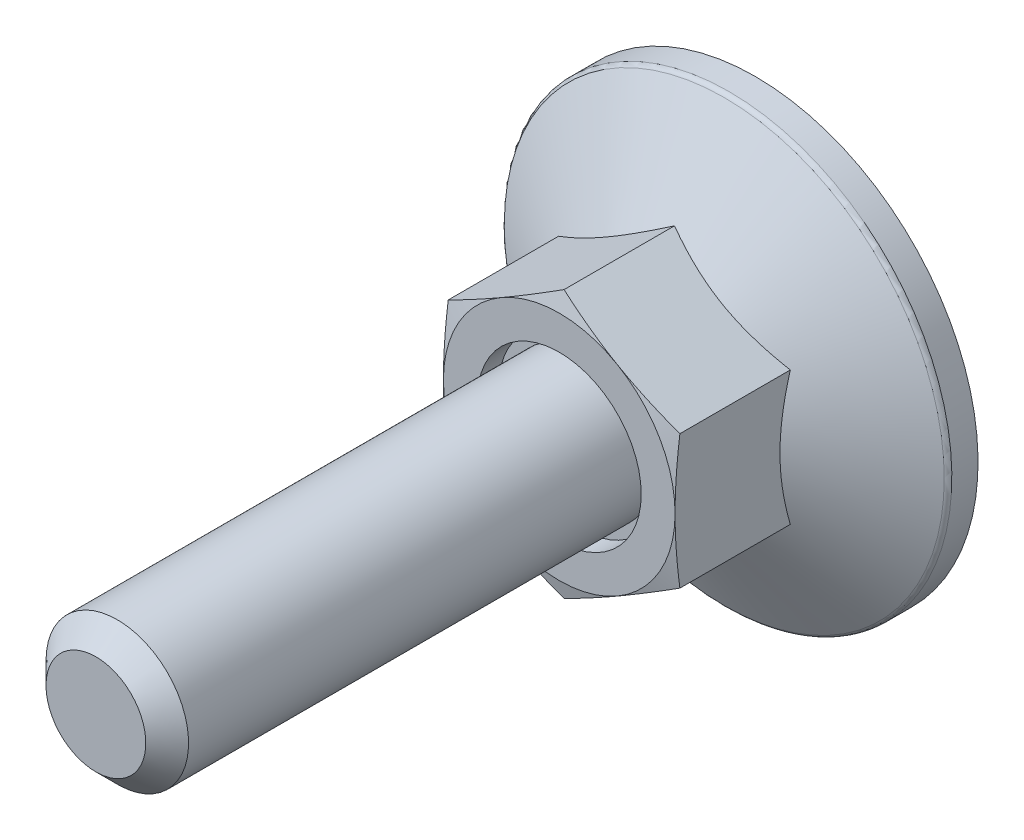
ISO-10303-21;
HEADER;
FILE_DESCRIPTION(('STEP AP214'),'2;1');
FILE_NAME('part.step','',(''),(''),'','','');
FILE_SCHEMA(('AUTOMOTIVE_DESIGN { 1 0 10303 214 1 1 1 1 }'));
ENDSEC;
DATA;
#1=APPLICATION_CONTEXT('core data for automotive mechanical design processes');
#2=APPLICATION_PROTOCOL_DEFINITION('international standard','automotive_design',2000,#1);
#3=PRODUCT_CONTEXT('',#1,'mechanical');
#4=PRODUCT('Part','Part','',(#3));
#5=PRODUCT_RELATED_PRODUCT_CATEGORY('part','',(#4));
#6=PRODUCT_DEFINITION_FORMATION('','',#4);
#7=PRODUCT_DEFINITION_CONTEXT('part definition',#1,'design');
#8=PRODUCT_DEFINITION('design','',#6,#7);
#9=PRODUCT_DEFINITION_SHAPE('','',#8);
#10=(LENGTH_UNIT() NAMED_UNIT(*) SI_UNIT(.MILLI.,.METRE.));
#11=(NAMED_UNIT(*) PLANE_ANGLE_UNIT() SI_UNIT($,.RADIAN.));
#12=(NAMED_UNIT(*) SI_UNIT($,.STERADIAN.) SOLID_ANGLE_UNIT());
#13=UNCERTAINTY_MEASURE_WITH_UNIT(LENGTH_MEASURE(1.E-05),#10,'distance_accuracy_value','');
#14=(GEOMETRIC_REPRESENTATION_CONTEXT(3) GLOBAL_UNCERTAINTY_ASSIGNED_CONTEXT((#13)) GLOBAL_UNIT_ASSIGNED_CONTEXT((#10,
#11,#12)) REPRESENTATION_CONTEXT('',''));
#15=CARTESIAN_POINT('',(0.,0.,0.));
#16=DIRECTION('',(0.,0.,1.));
#17=DIRECTION('',(1.,0.,0.));
#18=AXIS2_PLACEMENT_3D('',#15,#16,#17);
#19=CARTESIAN_POINT('',(0.,0.,9.8));
#20=DIRECTION('',(0.,0.,-1.));
#21=DIRECTION('',(0.,1.,0.));
#22=AXIS2_PLACEMENT_3D('',#19,#20,#21);
#23=PLANE('',#22);
#24=CARTESIAN_POINT('',(0.,0.,9.8));
#25=DIRECTION('',(0.,0.,-1.));
#26=DIRECTION('',(-1.,0.,0.));
#27=AXIS2_PLACEMENT_3D('',#24,#25,#26);
#28=CIRCLE('',#27,4.6);
#29=CARTESIAN_POINT('',(-4.6,0.,9.8));
#30=VERTEX_POINT('',#29);
#31=EDGE_CURVE('E346',#30,#30,#28,.F.);
#32=ORIENTED_EDGE('',*,*,#31,.T.);
#33=EDGE_LOOP('',(#32));
#34=FACE_BOUND('',#33,.T.);
#35=CARTESIAN_POINT('',(0.,0.,9.8));
#36=DIRECTION('',(0.,0.,-1.));
#37=DIRECTION('',(-1.,0.,0.));
#38=AXIS2_PLACEMENT_3D('',#35,#36,#37);
#39=CIRCLE('',#38,4.);
#40=CARTESIAN_POINT('',(-4.,0.,9.8));
#41=VERTEX_POINT('',#40);
#42=EDGE_CURVE('E349',#41,#41,#39,.F.);
#43=ORIENTED_EDGE('',*,*,#42,.F.);
#44=EDGE_LOOP('',(#43));
#45=FACE_BOUND('',#44,.T.);
#46=ADVANCED_FACE('F14',(#34,#45),#23,.F.);
#47=CARTESIAN_POINT('',(7.8,0.,0.));
#48=DIRECTION('',(0.,0.,1.));
#49=DIRECTION('',(0.,-1.,0.));
#50=AXIS2_PLACEMENT_3D('',#47,#48,#49);
#51=PLANE('',#50);
#52=DIRECTION('',(1.,0.,0.));
#53=VECTOR('',#52,1.);
#54=CARTESIAN_POINT('',(1.,-1.,0.));
#55=LINE('',#54,#53);
#56=CARTESIAN_POINT('',(1.,-1.,0.));
#57=VERTEX_POINT('',#56);
#58=CARTESIAN_POINT('',(4.16666666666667,-1.,0.));
#59=VERTEX_POINT('',#58);
#60=EDGE_CURVE('E697',#57,#59,#55,.T.);
#61=ORIENTED_EDGE('',*,*,#60,.T.);
#62=DIRECTION('',(0.,-1.,0.));
#63=VECTOR('',#62,1.);
#64=CARTESIAN_POINT('',(4.16666666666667,0.,0.));
#65=LINE('',#64,#63);
#66=CARTESIAN_POINT('',(4.16666666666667,1.,0.));
#67=VERTEX_POINT('',#66);
#68=EDGE_CURVE('E351',#67,#59,#65,.T.);
#69=ORIENTED_EDGE('',*,*,#68,.F.);
#70=DIRECTION('',(-1.,0.,0.));
#71=VECTOR('',#70,1.);
#72=CARTESIAN_POINT('',(4.16666666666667,1.,0.));
#73=LINE('',#72,#71);
#74=CARTESIAN_POINT('',(1.,1.,0.));
#75=VERTEX_POINT('',#74);
#76=EDGE_CURVE('E700',#67,#75,#73,.T.);
#77=ORIENTED_EDGE('',*,*,#76,.T.);
#78=DIRECTION('',(0.,1.,0.));
#79=VECTOR('',#78,1.);
#80=CARTESIAN_POINT('',(1.,1.,0.));
#81=LINE('',#80,#79);
#82=CARTESIAN_POINT('',(1.,4.16666666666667,0.));
#83=VERTEX_POINT('',#82);
#84=EDGE_CURVE('E703',#75,#83,#81,.T.);
#85=ORIENTED_EDGE('',*,*,#84,.T.);
#86=DIRECTION('',(-1.,0.,0.));
#87=VECTOR('',#86,1.);
#88=CARTESIAN_POINT('',(1.,4.16666666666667,0.));
#89=LINE('',#88,#87);
#90=CARTESIAN_POINT('',(-1.,4.16666666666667,0.));
#91=VERTEX_POINT('',#90);
#92=EDGE_CURVE('E706',#83,#91,#89,.T.);
#93=ORIENTED_EDGE('',*,*,#92,.T.);
#94=DIRECTION('',(0.,-1.,0.));
#95=VECTOR('',#94,1.);
#96=CARTESIAN_POINT('',(-1.,4.16666666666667,0.));
#97=LINE('',#96,#95);
#98=CARTESIAN_POINT('',(-1.,1.,0.));
#99=VERTEX_POINT('',#98);
#100=EDGE_CURVE('E175',#91,#99,#97,.T.);
#101=ORIENTED_EDGE('',*,*,#100,.T.);
#102=DIRECTION('',(-1.,0.,0.));
#103=VECTOR('',#102,1.);
#104=CARTESIAN_POINT('',(-1.,1.,0.));
#105=LINE('',#104,#103);
#106=CARTESIAN_POINT('',(-4.16666666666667,1.,0.));
#107=VERTEX_POINT('',#106);
#108=EDGE_CURVE('E29',#99,#107,#105,.T.);
#109=ORIENTED_EDGE('',*,*,#108,.T.);
#110=DIRECTION('',(0.,-1.,0.));
#111=VECTOR('',#110,1.);
#112=CARTESIAN_POINT('',(-4.16666666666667,1.,0.));
#113=LINE('',#112,#111);
#114=CARTESIAN_POINT('',(-4.16666666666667,-1.,0.));
#115=VERTEX_POINT('',#114);
#116=EDGE_CURVE('E179',#107,#115,#113,.T.);
#117=ORIENTED_EDGE('',*,*,#116,.T.);
#118=DIRECTION('',(1.,0.,0.));
#119=VECTOR('',#118,1.);
#120=CARTESIAN_POINT('',(-4.16666666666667,-1.,0.));
#121=LINE('',#120,#119);
#122=CARTESIAN_POINT('',(-1.,-1.,0.));
#123=VERTEX_POINT('',#122);
#124=EDGE_CURVE('E685',#115,#123,#121,.T.);
#125=ORIENTED_EDGE('',*,*,#124,.T.);
#126=DIRECTION('',(0.,-1.,0.));
#127=VECTOR('',#126,1.);
#128=CARTESIAN_POINT('',(-1.,-1.,0.));
#129=LINE('',#128,#127);
#130=CARTESIAN_POINT('',(-1.,-4.16666666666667,0.));
#131=VERTEX_POINT('',#130);
#132=EDGE_CURVE('E688',#123,#131,#129,.T.);
#133=ORIENTED_EDGE('',*,*,#132,.T.);
#134=DIRECTION('',(1.,0.,0.));
#135=VECTOR('',#134,1.);
#136=CARTESIAN_POINT('',(-1.,-4.16666666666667,0.));
#137=LINE('',#136,#135);
#138=CARTESIAN_POINT('',(1.,-4.16666666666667,0.));
#139=VERTEX_POINT('',#138);
#140=EDGE_CURVE('E691',#131,#139,#137,.T.);
#141=ORIENTED_EDGE('',*,*,#140,.T.);
#142=DIRECTION('',(0.,1.,0.));
#143=VECTOR('',#142,1.);
#144=CARTESIAN_POINT('',(1.,-4.16666666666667,0.));
#145=LINE('',#144,#143);
#146=EDGE_CURVE('E694',#139,#57,#145,.T.);
#147=ORIENTED_EDGE('',*,*,#146,.T.);
#148=EDGE_LOOP('',(#61,#69,#77,#85,#93,#101,#109,#117,#125,#133,#141,#147));
#149=FACE_BOUND('',#148,.T.);
#150=CARTESIAN_POINT('',(0.,0.,0.));
#151=DIRECTION('',(0.,0.,-1.));
#152=DIRECTION('',(0.,1.,0.));
#153=AXIS2_PLACEMENT_3D('',#150,#151,#152);
#154=CIRCLE('',#153,12.5);
#155=CARTESIAN_POINT('',(0.,12.5,0.));
#156=VERTEX_POINT('',#155);
#157=EDGE_CURVE('E180',#156,#156,#154,.T.);
#158=ORIENTED_EDGE('',*,*,#157,.T.);
#159=EDGE_LOOP('',(#158));
#160=FACE_BOUND('',#159,.T.);
#161=ADVANCED_FACE('F294',(#149,#160),#51,.F.);
#162=CARTESIAN_POINT('',(0.,7.50555349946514,48.));
#163=DIRECTION('',(0.5,-0.866025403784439,0.));
#164=DIRECTION('',(0.866025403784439,0.5,0.));
#165=AXIS2_PLACEMENT_3D('',#162,#163,#164);
#166=PLANE('',#165);
#167=CARTESIAN_POINT('',(-6.5002,3.75266127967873,4.53347836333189));
#168=CARTESIAN_POINT('',(-6.35732254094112,3.83515161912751,4.58109719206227));
#169=CARTESIAN_POINT('',(-6.21391236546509,3.91794952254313,4.62655491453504));
#170=CARTESIAN_POINT('',(-5.92592736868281,4.08421773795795,4.7125529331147));
#171=CARTESIAN_POINT('',(-5.78135207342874,4.16768832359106,4.75309110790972));
#172=CARTESIAN_POINT('',(-5.34531134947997,4.41943655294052,4.86653061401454));
#173=CARTESIAN_POINT('',(-5.05212471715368,4.5887079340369,4.93105380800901));
#174=CARTESIAN_POINT('',(-4.61337625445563,4.84201947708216,5.00671503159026));
#175=CARTESIAN_POINT('',(-4.46912536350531,4.92530276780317,5.02826875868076));
#176=CARTESIAN_POINT('',(-4.17997178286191,5.09224566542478,5.06441130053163));
#177=CARTESIAN_POINT('',(-4.03506915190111,5.17590523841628,5.07900073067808));
#178=CARTESIAN_POINT('',(-3.74501222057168,5.34336968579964,5.1008428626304));
#179=CARTESIAN_POINT('',(-3.59985839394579,5.42717428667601,5.10810389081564));
#180=CARTESIAN_POINT('',(-3.30942466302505,5.59485627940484,5.11514131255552));
#181=CARTESIAN_POINT('',(-3.16414476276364,5.6787336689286,5.11491793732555));
#182=CARTESIAN_POINT('',(-2.7661240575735,5.90853103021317,5.10401815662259));
#183=CARTESIAN_POINT('',(-2.51351353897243,6.05437578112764,5.08571979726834));
#184=CARTESIAN_POINT('',(-2.00997032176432,6.34509659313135,5.02769527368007));
#185=CARTESIAN_POINT('',(-1.75903939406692,6.48997163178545,4.98794927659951));
#186=CARTESIAN_POINT('',(-1.25448277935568,6.78127752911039,4.8885957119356));
#187=CARTESIAN_POINT('',(-1.00092075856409,6.92767163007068,4.82856718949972));
#188=CARTESIAN_POINT('',(-0.497578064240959,7.21827667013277,4.69232662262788));
#189=CARTESIAN_POINT('',(-0.247790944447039,7.36249133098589,4.61614658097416));
#190=CARTESIAN_POINT('',(0.000199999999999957,7.50566896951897,4.53347836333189));
#191=B_SPLINE_CURVE_WITH_KNOTS('',3,(#167,#168,#169,#170,#171,#172,#173,#174,#175,#176,#177,
#178,#179,#180,#181,#182,#183,#184,#185,#186,#187,#188,#189,#190),.UNSPECIFIED.,.F.,.F.,(4,2,2,
2,2,2,2,2,2,2,2,4),(0.,0.515105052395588,1.03043143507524,2.06322554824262,2.56697389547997,
3.07067772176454,3.57380860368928,4.0769239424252,4.9527935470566,5.82947446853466,
6.72559912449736,7.61996451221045),.UNSPECIFIED.);
#192=CARTESIAN_POINT('',(-6.5,3.75277674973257,4.53354503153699));
#193=VERTEX_POINT('',#192);
#194=CARTESIAN_POINT('',(0.,7.50555349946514,4.53354503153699));
#195=VERTEX_POINT('',#194);
#196=EDGE_CURVE('E251',#193,#195,#191,.T.);
#197=ORIENTED_EDGE('',*,*,#196,.F.);
#198=DIRECTION('',(0.,0.,-1.));
#199=VECTOR('',#198,1.);
#200=CARTESIAN_POINT('',(-6.5,3.75277674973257,48.));
#201=LINE('',#200,#199);
#202=CARTESIAN_POINT('',(-6.5,3.75277674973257,10.730562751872));
#203=VERTEX_POINT('',#202);
#204=EDGE_CURVE('E408',#203,#193,#201,.T.);
#205=ORIENTED_EDGE('',*,*,#204,.F.);
#206=CARTESIAN_POINT('',(0.0002,7.50566896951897,10.7305318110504));
#207=CARTESIAN_POINT('',(-0.26974524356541,7.34981601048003,10.772310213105));
#208=CARTESIAN_POINT('',(-0.540179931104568,7.19368047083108,10.8102381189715));
#209=CARTESIAN_POINT('',(-1.08200437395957,6.88085798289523,10.8768739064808));
#210=CARTESIAN_POINT('',(-1.35339447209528,6.72417083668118,10.9055780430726));
#211=CARTESIAN_POINT('',(-1.8954842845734,6.41119513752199,10.9520905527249));
#212=CARTESIAN_POINT('',(-2.16618033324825,6.25490870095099,10.9699543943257));
#213=CARTESIAN_POINT('',(-2.70791763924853,5.94213652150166,10.9939079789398));
#214=CARTESIAN_POINT('',(-2.97895881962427,5.78565082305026,11.));
#215=CARTESIAN_POINT('',(-3.52104118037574,5.47267942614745,11.));
#216=CARTESIAN_POINT('',(-3.79208236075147,5.31619372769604,10.9939079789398));
#217=CARTESIAN_POINT('',(-4.33381966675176,5.00342154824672,10.9699543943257));
#218=CARTESIAN_POINT('',(-4.60451571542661,4.84713511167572,10.9520905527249));
#219=CARTESIAN_POINT('',(-5.14660552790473,4.53415941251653,10.9055780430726));
#220=CARTESIAN_POINT('',(-5.41799562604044,4.37747226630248,10.8768739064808));
#221=CARTESIAN_POINT('',(-5.95982006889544,4.06464977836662,10.8102381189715));
#222=CARTESIAN_POINT('',(-6.23025475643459,3.90851423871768,10.772310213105));
#223=CARTESIAN_POINT('',(-6.5002,3.75266127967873,10.7305318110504));
#224=B_SPLINE_CURVE_WITH_KNOTS('',3,(#206,#207,#208,#209,#210,#211,#212,#213,#214,#215,#216,
#217,#218,#219,#220,#221,#222,#223),.UNSPECIFIED.,.F.,.F.,(4,2,2,2,2,2,2,2,4),(0.,
0.943529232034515,1.88744107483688,2.82648138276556,3.76533995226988,4.70419852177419,
5.64323882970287,6.58715067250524,7.53067990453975),.UNSPECIFIED.);
#225=CARTESIAN_POINT('',(-3.25,5.62916512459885,11.));
#226=VERTEX_POINT('',#225);
#227=EDGE_CURVE('E281',#226,#203,#224,.T.);
#228=ORIENTED_EDGE('',*,*,#227,.F.);
#229=CARTESIAN_POINT('',(0.,7.50555349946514,10.730562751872));
#230=VERTEX_POINT('',#229);
#231=EDGE_CURVE('E372',#230,#226,#224,.T.);
#232=ORIENTED_EDGE('',*,*,#231,.F.);
#233=DIRECTION('',(0.,0.,-1.));
#234=VECTOR('',#233,1.);
#235=CARTESIAN_POINT('',(0.,7.50555349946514,48.));
#236=LINE('',#235,#234);
#237=EDGE_CURVE('E392',#230,#195,#236,.T.);
#238=ORIENTED_EDGE('',*,*,#237,.T.);
#239=EDGE_LOOP('',(#197,#205,#228,#232,#238));
#240=FACE_BOUND('',#239,.T.);
#241=ADVANCED_FACE('F223',(#240),#166,.F.);
#242=CARTESIAN_POINT('',(6.5,3.75277674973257,48.));
#243=DIRECTION('',(-0.5,-0.866025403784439,0.));
#244=DIRECTION('',(0.866025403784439,-0.5,0.));
#245=AXIS2_PLACEMENT_3D('',#242,#243,#244);
#246=PLANE('',#245);
#247=CARTESIAN_POINT('',(-0.0002,7.50566896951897,4.53347836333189));
#248=CARTESIAN_POINT('',(0.142677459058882,7.4231786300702,4.58109719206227));
#249=CARTESIAN_POINT('',(0.286087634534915,7.34038072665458,4.62655491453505));
#250=CARTESIAN_POINT('',(0.574072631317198,7.17411251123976,4.71255293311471));
#251=CARTESIAN_POINT('',(0.718647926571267,7.09064192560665,4.75309110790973));
#252=CARTESIAN_POINT('',(1.15468865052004,6.83889369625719,4.86653061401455));
#253=CARTESIAN_POINT('',(1.44787528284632,6.66962231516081,4.93105380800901));
#254=CARTESIAN_POINT('',(1.88662374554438,6.41631077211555,5.00671503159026));
#255=CARTESIAN_POINT('',(2.03087463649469,6.33302748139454,5.02826875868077));
#256=CARTESIAN_POINT('',(2.32002821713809,6.16608458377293,5.06441130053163));
#257=CARTESIAN_POINT('',(2.46493084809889,6.08242501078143,5.07900073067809));
#258=CARTESIAN_POINT('',(2.75498777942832,5.91496056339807,5.10084286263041));
#259=CARTESIAN_POINT('',(2.90014160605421,5.8311559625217,5.10810389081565));
#260=CARTESIAN_POINT('',(3.19057533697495,5.66347396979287,5.11514131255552));
#261=CARTESIAN_POINT('',(3.33585523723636,5.5795965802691,5.11491793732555));
#262=CARTESIAN_POINT('',(3.73387594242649,5.34979921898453,5.10401815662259));
#263=CARTESIAN_POINT('',(3.98648646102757,5.20395446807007,5.08571979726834));
#264=CARTESIAN_POINT('',(4.49002967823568,4.91323365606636,5.02769527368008));
#265=CARTESIAN_POINT('',(4.74096060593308,4.76835861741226,4.98794927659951));
#266=CARTESIAN_POINT('',(5.24551722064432,4.47705272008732,4.8885957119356));
#267=CARTESIAN_POINT('',(5.49907924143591,4.33065861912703,4.82856718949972));
#268=CARTESIAN_POINT('',(6.00242193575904,4.04005357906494,4.69232662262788));
#269=CARTESIAN_POINT('',(6.25220905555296,3.89583891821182,4.61614658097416));
#270=CARTESIAN_POINT('',(6.5002,3.75266127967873,4.53347836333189));
#271=B_SPLINE_CURVE_WITH_KNOTS('',3,(#247,#248,#249,#250,#251,#252,#253,#254,#255,#256,#257,
#258,#259,#260,#261,#262,#263,#264,#265,#266,#267,#268,#269,#270),.UNSPECIFIED.,.F.,.F.,(4,2,2,
2,2,2,2,2,2,2,2,4),(0.,0.515105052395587,1.03043143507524,2.06322554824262,2.56697389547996,
3.07067772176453,3.57380860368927,4.0769239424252,4.9527935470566,5.82947446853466,
6.72559912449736,7.61996451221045),.UNSPECIFIED.);
#272=CARTESIAN_POINT('',(6.5,3.75277674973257,4.53354503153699));
#273=VERTEX_POINT('',#272);
#274=EDGE_CURVE('E37',#195,#273,#271,.T.);
#275=ORIENTED_EDGE('',*,*,#274,.F.);
#276=ORIENTED_EDGE('',*,*,#237,.F.);
#277=CARTESIAN_POINT('',(6.5002,3.75266127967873,10.7305318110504));
#278=CARTESIAN_POINT('',(6.23025475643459,3.90851423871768,10.772310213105));
#279=CARTESIAN_POINT('',(5.95982006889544,4.06464977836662,10.8102381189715));
#280=CARTESIAN_POINT('',(5.41799562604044,4.37747226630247,10.8768739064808));
#281=CARTESIAN_POINT('',(5.14660552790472,4.53415941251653,10.9055780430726));
#282=CARTESIAN_POINT('',(4.60451571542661,4.84713511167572,10.9520905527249));
#283=CARTESIAN_POINT('',(4.33381966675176,5.00342154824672,10.9699543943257));
#284=CARTESIAN_POINT('',(3.79208236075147,5.31619372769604,10.9939079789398));
#285=CARTESIAN_POINT('',(3.52104118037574,5.47267942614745,11.));
#286=CARTESIAN_POINT('',(2.97895881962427,5.78565082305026,11.));
#287=CARTESIAN_POINT('',(2.70791763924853,5.94213652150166,10.9939079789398));
#288=CARTESIAN_POINT('',(2.16618033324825,6.25490870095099,10.9699543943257));
#289=CARTESIAN_POINT('',(1.89548428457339,6.41119513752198,10.9520905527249));
#290=CARTESIAN_POINT('',(1.35339447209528,6.72417083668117,10.9055780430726));
#291=CARTESIAN_POINT('',(1.08200437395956,6.88085798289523,10.8768739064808));
#292=CARTESIAN_POINT('',(0.540179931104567,7.19368047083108,10.8102381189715));
#293=CARTESIAN_POINT('',(0.26974524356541,7.34981601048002,10.772310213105));
#294=CARTESIAN_POINT('',(-0.000199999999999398,7.50566896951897,10.7305318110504));
#295=B_SPLINE_CURVE_WITH_KNOTS('',3,(#277,#278,#279,#280,#281,#282,#283,#284,#285,#286,#287,
#288,#289,#290,#291,#292,#293,#294),.UNSPECIFIED.,.F.,.F.,(4,2,2,2,2,2,2,2,4),(0.,
0.943529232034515,1.88744107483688,2.82648138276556,3.76533995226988,4.70419852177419,
5.64323882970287,6.58715067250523,7.53067990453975),.UNSPECIFIED.);
#296=CARTESIAN_POINT('',(3.25,5.62916512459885,11.));
#297=VERTEX_POINT('',#296);
#298=EDGE_CURVE('E264',#297,#230,#295,.T.);
#299=ORIENTED_EDGE('',*,*,#298,.F.);
#300=CARTESIAN_POINT('',(6.5,3.75277674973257,10.730562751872));
#301=VERTEX_POINT('',#300);
#302=EDGE_CURVE('E273',#301,#297,#295,.T.);
#303=ORIENTED_EDGE('',*,*,#302,.F.);
#304=DIRECTION('',(0.,0.,-1.));
#305=VECTOR('',#304,1.);
#306=CARTESIAN_POINT('',(6.5,3.75277674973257,48.));
#307=LINE('',#306,#305);
#308=EDGE_CURVE('E395',#301,#273,#307,.T.);
#309=ORIENTED_EDGE('',*,*,#308,.T.);
#310=EDGE_LOOP('',(#275,#276,#299,#303,#309));
#311=FACE_BOUND('',#310,.T.);
#312=ADVANCED_FACE('F257',(#311),#246,.F.);
#313=CARTESIAN_POINT('',(6.5,-3.75277674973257,48.));
#314=DIRECTION('',(-1.,0.,0.));
#315=DIRECTION('',(0.,-1.,0.));
#316=AXIS2_PLACEMENT_3D('',#313,#314,#315);
#317=PLANE('',#316);
#318=CARTESIAN_POINT('',(6.5,10.067414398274,1.94823609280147));
#319=CARTESIAN_POINT('',(6.5,9.78352438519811,2.08589580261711));
#320=CARTESIAN_POINT('',(6.5,9.49898106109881,2.22223138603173));
#321=CARTESIAN_POINT('',(6.5,8.92824011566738,2.49150895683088));
#322=CARTESIAN_POINT('',(6.5,8.64204224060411,2.62445040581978));
#323=CARTESIAN_POINT('',(6.5,8.06616487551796,2.88686541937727));
#324=CARTESIAN_POINT('',(6.5,7.77647490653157,3.01631606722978));
#325=CARTESIAN_POINT('',(6.5,7.19478507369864,3.26989907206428));
#326=CARTESIAN_POINT('',(6.5,6.90278532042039,3.39403168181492));
#327=CARTESIAN_POINT('',(6.5,6.30684739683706,3.63934571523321));
#328=CARTESIAN_POINT('',(6.5,6.00282105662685,3.76031411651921));
#329=CARTESIAN_POINT('',(6.5,5.39120706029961,3.99306391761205));
#330=CARTESIAN_POINT('',(6.5,5.08361900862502,4.10484428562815));
#331=CARTESIAN_POINT('',(6.5,4.46497231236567,4.31627594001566));
#332=CARTESIAN_POINT('',(6.5,4.15392216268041,4.41595183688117));
#333=CARTESIAN_POINT('',(6.5,3.52735818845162,4.59996747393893));
#334=CARTESIAN_POINT('',(6.5,3.21184580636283,4.68431205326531));
#335=CARTESIAN_POINT('',(6.5,2.57783458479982,4.83319256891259));
#336=CARTESIAN_POINT('',(6.5,2.25935972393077,4.89782898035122));
#337=CARTESIAN_POINT('',(6.5,1.61842059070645,5.00357646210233));
#338=CARTESIAN_POINT('',(6.5,1.29595672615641,5.04468991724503));
#339=CARTESIAN_POINT('',(6.5,0.812693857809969,5.08598811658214));
#340=CARTESIAN_POINT('',(6.5,0.652724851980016,5.09635596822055));
#341=CARTESIAN_POINT('',(6.5,0.332484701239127,5.11032435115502));
#342=CARTESIAN_POINT('',(6.5,0.172213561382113,5.11392499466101));
#343=CARTESIAN_POINT('',(6.5,-0.148338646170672,5.11426557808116));
#344=CARTESIAN_POINT('',(6.5,-0.30861971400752,5.11100536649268));
#345=CARTESIAN_POINT('',(6.5,-0.628902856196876,5.09770543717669));
#346=CARTESIAN_POINT('',(6.5,-0.788904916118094,5.08766537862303));
#347=CARTESIAN_POINT('',(6.5,-1.17366735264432,5.05558094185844));
#348=CARTESIAN_POINT('',(6.5,-1.39816400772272,5.03030719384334));
#349=CARTESIAN_POINT('',(6.5,-1.84547349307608,4.96779217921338));
#350=CARTESIAN_POINT('',(6.5,-2.06828609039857,4.93054928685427));
#351=CARTESIAN_POINT('',(6.5,-2.73393776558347,4.80284369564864));
#352=CARTESIAN_POINT('',(6.5,-3.17375537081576,4.6964262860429));
#353=CARTESIAN_POINT('',(6.5,-3.83171733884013,4.51203063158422));
#354=CARTESIAN_POINT('',(6.5,-4.05327258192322,4.44552609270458));
#355=CARTESIAN_POINT('',(6.5,-4.49422901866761,4.30565892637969));
#356=CARTESIAN_POINT('',(6.5,-4.71363019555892,4.23229624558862));
#357=CARTESIAN_POINT('',(6.5,-5.15035386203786,4.07988627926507));
#358=CARTESIAN_POINT('',(6.5,-5.3676769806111,4.00084077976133));
#359=CARTESIAN_POINT('',(6.5,-5.80052072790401,3.83799065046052));
#360=CARTESIAN_POINT('',(6.5,-6.01604140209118,3.75418614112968));
#361=CARTESIAN_POINT('',(6.5,-6.61842771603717,3.51353035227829));
#362=CARTESIAN_POINT('',(6.5,-7.00350435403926,3.35220459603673));
#363=CARTESIAN_POINT('',(6.5,-7.76959629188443,3.02014813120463));
#364=CARTESIAN_POINT('',(6.5,-8.15061109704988,2.84941629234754));
#365=CARTESIAN_POINT('',(6.5,-8.90957192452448,2.50088582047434));
#366=CARTESIAN_POINT('',(6.5,-9.28751663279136,2.3230843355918));
#367=CARTESIAN_POINT('',(6.5,-10.0408394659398,1.96218611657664));
#368=CARTESIAN_POINT('',(6.5,-10.4162177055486,1.77908962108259));
#369=CARTESIAN_POINT('',(6.5,-11.1655631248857,1.40849620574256));
#370=CARTESIAN_POINT('',(6.5,-11.5395269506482,1.22099251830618));
#371=CARTESIAN_POINT('',(6.5,-12.2858210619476,0.842758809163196));
#372=CARTESIAN_POINT('',(6.5,-12.6581513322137,0.652028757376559));
#373=CARTESIAN_POINT('',(6.5,-13.4013949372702,0.268043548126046));
#374=CARTESIAN_POINT('',(6.5,-13.7723085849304,0.0747889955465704));
#375=CARTESIAN_POINT('',(6.5,-14.5130449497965,-0.313800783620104));
#376=CARTESIAN_POINT('',(6.5,-14.8828676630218,-0.509136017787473));
#377=CARTESIAN_POINT('',(6.5,-15.9085714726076,-1.05391022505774));
#378=CARTESIAN_POINT('',(6.5,-16.5634819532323,-1.40517623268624));
#379=CARTESIAN_POINT('',(6.5,-17.8712672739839,-2.11157255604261));
#380=CARTESIAN_POINT('',(6.5,-18.5241419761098,-2.4667031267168));
#381=CARTESIAN_POINT('',(6.5,-19.8261496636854,-3.17862531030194));
#382=CARTESIAN_POINT('',(6.5,-20.475287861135,-3.53540739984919));
#383=CARTESIAN_POINT('',(6.5,-21.7722968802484,-4.25114422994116));
#384=CARTESIAN_POINT('',(6.5,-22.4201678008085,-4.61009879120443));
#385=CARTESIAN_POINT('',(6.5,-23.0675997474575,-4.9698379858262));
#386=B_SPLINE_CURVE_WITH_KNOTS('',3,(#318,#319,#320,#321,#322,#323,#324,#325,#326,#327,#328,
#329,#330,#331,#332,#333,#334,#335,#336,#337,#338,#339,#340,#341,#342,#343,#344,#345,#346,#347,
#348,#349,#350,#351,#352,#353,#354,#355,#356,#357,#358,#359,#360,#361,#362,#363,#364,#365,#366,
#367,#368,#369,#370,#371,#372,#373,#374,#375,#376,#377,#378,#379,#380,#381,#382,#383,#384,#385),
.UNSPECIFIED.,.F.,.F.,(4,2,2,2,2,2,2,2,2,2,2,2,2,2,2,2,2,2,2,2,2,2,2,2,2,2,2,2,2,2,2,2,2,4),(0.,
0.946528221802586,1.89320566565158,2.84505559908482,3.79686024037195,4.77837094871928,
5.75999172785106,6.73958204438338,7.71886262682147,8.69306383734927,9.66716626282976,
10.1479587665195,10.6287432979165,11.1095384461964,11.5903577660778,12.267719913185,
12.9451741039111,14.3007885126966,14.9946950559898,15.6886069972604,16.3823017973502,
17.0759790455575,18.3282990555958,19.5807698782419,20.8337511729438,22.086676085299,
23.3416700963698,24.5966758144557,25.8513861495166,27.1061010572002,29.335578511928,
31.5652039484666,33.7873748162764,36.0093647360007),.UNSPECIFIED.);
#387=CARTESIAN_POINT('',(6.5,-3.75277674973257,4.53354503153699));
#388=VERTEX_POINT('',#387);
#389=EDGE_CURVE('E240',#273,#388,#386,.T.);
#390=ORIENTED_EDGE('',*,*,#389,.F.);
#391=ORIENTED_EDGE('',*,*,#308,.F.);
#392=CARTESIAN_POINT('',(6.5,9.92747995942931,9.56215186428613));
#393=CARTESIAN_POINT('',(6.5,9.63259364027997,9.62823955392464));
#394=CARTESIAN_POINT('',(6.5,9.33752287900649,9.69351898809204));
#395=CARTESIAN_POINT('',(6.5,8.7469218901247,9.82202506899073));
#396=CARTESIAN_POINT('',(6.5,8.45139164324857,9.88525162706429));
#397=CARTESIAN_POINT('',(6.5,7.85951636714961,10.0092707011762));
#398=CARTESIAN_POINT('',(6.5,7.56317082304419,10.0700607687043));
#399=CARTESIAN_POINT('',(6.5,6.96986292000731,10.1885506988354));
#400=CARTESIAN_POINT('',(6.5,6.67290056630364,10.2462505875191));
#401=CARTESIAN_POINT('',(6.5,6.08062010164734,10.3573796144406));
#402=CARTESIAN_POINT('',(6.5,5.78530770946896,10.4108390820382));
#403=CARTESIAN_POINT('',(6.5,5.19387740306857,10.513090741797));
#404=CARTESIAN_POINT('',(6.5,4.89775950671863,10.5618830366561));
#405=CARTESIAN_POINT('',(6.5,4.30466070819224,10.6537017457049));
#406=CARTESIAN_POINT('',(6.5,4.00767991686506,10.6967288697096));
#407=CARTESIAN_POINT('',(6.5,3.4127732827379,10.7757492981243));
#408=CARTESIAN_POINT('',(6.5,3.1148474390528,10.8117425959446));
#409=CARTESIAN_POINT('',(6.5,2.51468954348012,10.8756761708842));
#410=CARTESIAN_POINT('',(6.5,2.21244707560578,10.9035201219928));
#411=CARTESIAN_POINT('',(6.5,1.60720229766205,10.9492341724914));
#412=CARTESIAN_POINT('',(6.5,1.30420000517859,10.9671045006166));
#413=CARTESIAN_POINT('',(6.5,0.697875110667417,10.9918290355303));
#414=CARTESIAN_POINT('',(6.5,0.394552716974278,10.9986882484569));
#415=CARTESIAN_POINT('',(6.5,-0.212135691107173,11.0009688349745));
#416=CARTESIAN_POINT('',(6.5,-0.515501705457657,10.9963902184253));
#417=CARTESIAN_POINT('',(6.5,-1.12295501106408,10.9760526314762));
#418=CARTESIAN_POINT('',(6.5,-1.42704091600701,10.9602530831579));
#419=CARTESIAN_POINT('',(6.5,-2.03449758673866,10.9183754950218));
#420=CARTESIAN_POINT('',(6.5,-2.33786833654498,10.8922972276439));
#421=CARTESIAN_POINT('',(6.5,-2.94389214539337,10.8311794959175));
#422=CARTESIAN_POINT('',(6.5,-3.24654460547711,10.7961341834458));
#423=CARTESIAN_POINT('',(6.5,-3.85087551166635,10.7185406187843));
#424=CARTESIAN_POINT('',(6.5,-4.15255395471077,10.6759923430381));
#425=CARTESIAN_POINT('',(6.5,-4.73502363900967,10.5877746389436));
#426=CARTESIAN_POINT('',(6.5,-5.01587505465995,10.5424985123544));
#427=CARTESIAN_POINT('',(6.5,-5.57683763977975,10.4475514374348));
#428=CARTESIAN_POINT('',(6.5,-5.85694878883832,10.3978803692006));
#429=CARTESIAN_POINT('',(6.5,-6.41653333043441,10.2949474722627));
#430=CARTESIAN_POINT('',(6.5,-6.69600666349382,10.241685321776));
#431=CARTESIAN_POINT('',(6.5,-7.2543793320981,10.1322258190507));
#432=CARTESIAN_POINT('',(6.5,-7.53327866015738,10.0760284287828));
#433=CARTESIAN_POINT('',(6.5,-8.36936246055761,9.90383082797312));
#434=CARTESIAN_POINT('',(6.5,-8.92580841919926,9.78424858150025));
#435=CARTESIAN_POINT('',(6.5,-10.037220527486,9.53861051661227));
#436=CARTESIAN_POINT('',(6.5,-10.5921867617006,9.41255507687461));
#437=CARTESIAN_POINT('',(6.5,-11.6956125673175,9.15714489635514));
#438=CARTESIAN_POINT('',(6.5,-12.2440824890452,9.02783474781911));
#439=CARTESIAN_POINT('',(6.5,-13.3402571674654,8.76597711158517));
#440=CARTESIAN_POINT('',(6.5,-13.8879619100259,8.63342956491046));
#441=CARTESIAN_POINT('',(6.5,-14.9821103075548,8.36610757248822));
#442=CARTESIAN_POINT('',(6.5,-15.5285546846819,8.23133607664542));
#443=CARTESIAN_POINT('',(6.5,-16.620967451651,7.95995280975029));
#444=CARTESIAN_POINT('',(6.5,-17.166935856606,7.82334109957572));
#445=CARTESIAN_POINT('',(6.5,-17.7127383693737,7.6860776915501));
#446=B_SPLINE_CURVE_WITH_KNOTS('',3,(#392,#393,#394,#395,#396,#397,#398,#399,#400,#401,#402,
#403,#404,#405,#406,#407,#408,#409,#410,#411,#412,#413,#414,#415,#416,#417,#418,#419,#420,#421,
#422,#423,#424,#425,#426,#427,#428,#429,#430,#431,#432,#433,#434,#435,#436,#437,#438,#439,#440,
#441,#442,#443,#444,#445),.UNSPECIFIED.,.F.,.F.,(4,2,2,2,2,2,2,2,2,2,2,2,2,2,2,2,2,2,2,2,2,2,2,
2,2,2,4),(0.,0.906607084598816,1.8132532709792,2.72078883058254,3.62831672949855,
4.52862337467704,5.42891020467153,6.32908608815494,7.22926281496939,8.13968571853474,
9.05008774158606,9.96007573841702,10.8700629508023,11.7833577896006,12.6966728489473,
13.6105850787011,14.5245001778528,15.3778915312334,16.2313061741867,17.084797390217,
17.9382996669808,19.6456836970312,21.3529679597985,23.0434756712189,24.7340142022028,
26.4224665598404,28.1108631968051),.UNSPECIFIED.);
#447=CARTESIAN_POINT('',(6.5,0.,11.));
#448=VERTEX_POINT('',#447);
#449=EDGE_CURVE('E275',#448,#301,#446,.F.);
#450=ORIENTED_EDGE('',*,*,#449,.F.);
#451=CARTESIAN_POINT('',(6.5,-3.75277674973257,10.730562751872));
#452=VERTEX_POINT('',#451);
#453=EDGE_CURVE('E274',#452,#448,#446,.F.);
#454=ORIENTED_EDGE('',*,*,#453,.F.);
#455=DIRECTION('',(0.,0.,-1.));
#456=VECTOR('',#455,1.);
#457=CARTESIAN_POINT('',(6.5,-3.75277674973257,48.));
#458=LINE('',#457,#456);
#459=EDGE_CURVE('E398',#452,#388,#458,.T.);
#460=ORIENTED_EDGE('',*,*,#459,.T.);
#461=EDGE_LOOP('',(#390,#391,#450,#454,#460));
#462=FACE_BOUND('',#461,.T.);
#463=ADVANCED_FACE('F260',(#462),#317,.F.);
#464=CARTESIAN_POINT('',(0.,-7.50555349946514,48.));
#465=DIRECTION('',(-0.5,0.866025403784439,0.));
#466=DIRECTION('',(-0.866025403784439,-0.5,0.));
#467=AXIS2_PLACEMENT_3D('',#464,#465,#466);
#468=PLANE('',#467);
#469=CARTESIAN_POINT('',(6.5002,-3.75266127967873,4.53347836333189));
#470=CARTESIAN_POINT('',(6.35732254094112,-3.83515161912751,4.58109719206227));
#471=CARTESIAN_POINT('',(6.21391236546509,-3.91794952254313,4.62655491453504));
#472=CARTESIAN_POINT('',(5.92592736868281,-4.08421773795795,4.7125529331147));
#473=CARTESIAN_POINT('',(5.78135207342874,-4.16768832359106,4.75309110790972));
#474=CARTESIAN_POINT('',(5.34531134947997,-4.41943655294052,4.86653061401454));
#475=CARTESIAN_POINT('',(5.05212471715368,-4.5887079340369,4.93105380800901));
#476=CARTESIAN_POINT('',(4.61337625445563,-4.84201947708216,5.00671503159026));
#477=CARTESIAN_POINT('',(4.46912536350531,-4.92530276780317,5.02826875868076));
#478=CARTESIAN_POINT('',(4.17997178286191,-5.09224566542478,5.06441130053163));
#479=CARTESIAN_POINT('',(4.03506915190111,-5.17590523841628,5.07900073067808));
#480=CARTESIAN_POINT('',(3.74501222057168,-5.34336968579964,5.1008428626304));
#481=CARTESIAN_POINT('',(3.59985839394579,-5.42717428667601,5.10810389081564));
#482=CARTESIAN_POINT('',(3.30942466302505,-5.59485627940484,5.11514131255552));
#483=CARTESIAN_POINT('',(3.16414476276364,-5.6787336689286,5.11491793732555));
#484=CARTESIAN_POINT('',(2.7661240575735,-5.90853103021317,5.10401815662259));
#485=CARTESIAN_POINT('',(2.51351353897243,-6.05437578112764,5.08571979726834));
#486=CARTESIAN_POINT('',(2.00997032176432,-6.34509659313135,5.02769527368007));
#487=CARTESIAN_POINT('',(1.75903939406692,-6.48997163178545,4.98794927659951));
#488=CARTESIAN_POINT('',(1.25448277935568,-6.78127752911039,4.8885957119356));
#489=CARTESIAN_POINT('',(1.00092075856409,-6.92767163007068,4.82856718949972));
#490=CARTESIAN_POINT('',(0.497578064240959,-7.21827667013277,4.69232662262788));
#491=CARTESIAN_POINT('',(0.247790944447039,-7.36249133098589,4.61614658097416));
#492=CARTESIAN_POINT('',(-0.000199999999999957,-7.50566896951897,4.53347836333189));
#493=B_SPLINE_CURVE_WITH_KNOTS('',3,(#469,#470,#471,#472,#473,#474,#475,#476,#477,#478,#479,
#480,#481,#482,#483,#484,#485,#486,#487,#488,#489,#490,#491,#492),.UNSPECIFIED.,.F.,.F.,(4,2,2,
2,2,2,2,2,2,2,2,4),(0.,0.515105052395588,1.03043143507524,2.06322554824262,2.56697389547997,
3.07067772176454,3.57380860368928,4.0769239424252,4.9527935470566,5.82947446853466,
6.72559912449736,7.61996451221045),.UNSPECIFIED.);
#494=CARTESIAN_POINT('',(0.,-7.50555349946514,4.53354503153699));
#495=VERTEX_POINT('',#494);
#496=EDGE_CURVE('E204',#388,#495,#493,.T.);
#497=ORIENTED_EDGE('',*,*,#496,.F.);
#498=ORIENTED_EDGE('',*,*,#459,.F.);
#499=CARTESIAN_POINT('',(-0.0002,-7.50566896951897,10.7305318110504));
#500=CARTESIAN_POINT('',(0.26974524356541,-7.34981601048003,10.772310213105));
#501=CARTESIAN_POINT('',(0.540179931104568,-7.19368047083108,10.8102381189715));
#502=CARTESIAN_POINT('',(1.08200437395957,-6.88085798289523,10.8768739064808));
#503=CARTESIAN_POINT('',(1.35339447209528,-6.72417083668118,10.9055780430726));
#504=CARTESIAN_POINT('',(1.8954842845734,-6.41119513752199,10.9520905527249));
#505=CARTESIAN_POINT('',(2.16618033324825,-6.25490870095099,10.9699543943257));
#506=CARTESIAN_POINT('',(2.70791763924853,-5.94213652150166,10.9939079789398));
#507=CARTESIAN_POINT('',(2.97895881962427,-5.78565082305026,11.));
#508=CARTESIAN_POINT('',(3.52104118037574,-5.47267942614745,11.));
#509=CARTESIAN_POINT('',(3.79208236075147,-5.31619372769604,10.9939079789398));
#510=CARTESIAN_POINT('',(4.33381966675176,-5.00342154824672,10.9699543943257));
#511=CARTESIAN_POINT('',(4.60451571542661,-4.84713511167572,10.9520905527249));
#512=CARTESIAN_POINT('',(5.14660552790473,-4.53415941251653,10.9055780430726));
#513=CARTESIAN_POINT('',(5.41799562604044,-4.37747226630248,10.8768739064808));
#514=CARTESIAN_POINT('',(5.95982006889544,-4.06464977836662,10.8102381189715));
#515=CARTESIAN_POINT('',(6.23025475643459,-3.90851423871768,10.772310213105));
#516=CARTESIAN_POINT('',(6.5002,-3.75266127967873,10.7305318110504));
#517=B_SPLINE_CURVE_WITH_KNOTS('',3,(#499,#500,#501,#502,#503,#504,#505,#506,#507,#508,#509,
#510,#511,#512,#513,#514,#515,#516),.UNSPECIFIED.,.F.,.F.,(4,2,2,2,2,2,2,2,4),(0.,
0.943529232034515,1.88744107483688,2.82648138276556,3.76533995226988,4.70419852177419,
5.64323882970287,6.58715067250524,7.53067990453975),.UNSPECIFIED.);
#518=CARTESIAN_POINT('',(3.25,-5.62916512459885,11.));
#519=VERTEX_POINT('',#518);
#520=EDGE_CURVE('E313',#519,#452,#517,.T.);
#521=ORIENTED_EDGE('',*,*,#520,.F.);
#522=CARTESIAN_POINT('',(0.,-7.50555349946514,10.730562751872));
#523=VERTEX_POINT('',#522);
#524=EDGE_CURVE('E319',#523,#519,#517,.T.);
#525=ORIENTED_EDGE('',*,*,#524,.F.);
#526=DIRECTION('',(0.,0.,-1.));
#527=VECTOR('',#526,1.);
#528=CARTESIAN_POINT('',(0.,-7.50555349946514,48.));
#529=LINE('',#528,#527);
#530=EDGE_CURVE('E403',#523,#495,#529,.T.);
#531=ORIENTED_EDGE('',*,*,#530,.T.);
#532=EDGE_LOOP('',(#497,#498,#521,#525,#531));
#533=FACE_BOUND('',#532,.T.);
#534=ADVANCED_FACE('F321',(#533),#468,.F.);
#535=CARTESIAN_POINT('',(-6.5,-3.75277674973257,48.));
#536=DIRECTION('',(0.5,0.866025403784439,0.));
#537=DIRECTION('',(-0.866025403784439,0.5,0.));
#538=AXIS2_PLACEMENT_3D('',#535,#536,#537);
#539=PLANE('',#538);
#540=CARTESIAN_POINT('',(0.0002,-7.50566896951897,4.53347836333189));
#541=CARTESIAN_POINT('',(-0.142677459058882,-7.4231786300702,4.58109719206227));
#542=CARTESIAN_POINT('',(-0.286087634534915,-7.34038072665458,4.62655491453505));
#543=CARTESIAN_POINT('',(-0.574072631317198,-7.17411251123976,4.71255293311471));
#544=CARTESIAN_POINT('',(-0.718647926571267,-7.09064192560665,4.75309110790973));
#545=CARTESIAN_POINT('',(-1.15468865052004,-6.83889369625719,4.86653061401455));
#546=CARTESIAN_POINT('',(-1.44787528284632,-6.66962231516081,4.93105380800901));
#547=CARTESIAN_POINT('',(-1.88662374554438,-6.41631077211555,5.00671503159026));
#548=CARTESIAN_POINT('',(-2.03087463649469,-6.33302748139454,5.02826875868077));
#549=CARTESIAN_POINT('',(-2.32002821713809,-6.16608458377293,5.06441130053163));
#550=CARTESIAN_POINT('',(-2.46493084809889,-6.08242501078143,5.07900073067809));
#551=CARTESIAN_POINT('',(-2.75498777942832,-5.91496056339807,5.10084286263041));
#552=CARTESIAN_POINT('',(-2.90014160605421,-5.8311559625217,5.10810389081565));
#553=CARTESIAN_POINT('',(-3.19057533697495,-5.66347396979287,5.11514131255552));
#554=CARTESIAN_POINT('',(-3.33585523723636,-5.5795965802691,5.11491793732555));
#555=CARTESIAN_POINT('',(-3.73387594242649,-5.34979921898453,5.10401815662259));
#556=CARTESIAN_POINT('',(-3.98648646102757,-5.20395446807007,5.08571979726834));
#557=CARTESIAN_POINT('',(-4.49002967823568,-4.91323365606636,5.02769527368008));
#558=CARTESIAN_POINT('',(-4.74096060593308,-4.76835861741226,4.98794927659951));
#559=CARTESIAN_POINT('',(-5.24551722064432,-4.47705272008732,4.8885957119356));
#560=CARTESIAN_POINT('',(-5.49907924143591,-4.33065861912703,4.82856718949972));
#561=CARTESIAN_POINT('',(-6.00242193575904,-4.04005357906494,4.69232662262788));
#562=CARTESIAN_POINT('',(-6.25220905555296,-3.89583891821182,4.61614658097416));
#563=CARTESIAN_POINT('',(-6.5002,-3.75266127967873,4.53347836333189));
#564=B_SPLINE_CURVE_WITH_KNOTS('',3,(#540,#541,#542,#543,#544,#545,#546,#547,#548,#549,#550,
#551,#552,#553,#554,#555,#556,#557,#558,#559,#560,#561,#562,#563),.UNSPECIFIED.,.F.,.F.,(4,2,2,
2,2,2,2,2,2,2,2,4),(0.,0.515105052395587,1.03043143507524,2.06322554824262,2.56697389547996,
3.07067772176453,3.57380860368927,4.0769239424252,4.9527935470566,5.82947446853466,
6.72559912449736,7.61996451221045),.UNSPECIFIED.);
#565=CARTESIAN_POINT('',(-6.5,-3.75277674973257,4.53354503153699));
#566=VERTEX_POINT('',#565);
#567=EDGE_CURVE('E195',#495,#566,#564,.T.);
#568=ORIENTED_EDGE('',*,*,#567,.F.);
#569=ORIENTED_EDGE('',*,*,#530,.F.);
#570=CARTESIAN_POINT('',(-6.5002,-3.75266127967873,10.7305318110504));
#571=CARTESIAN_POINT('',(-6.23025475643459,-3.90851423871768,10.772310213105));
#572=CARTESIAN_POINT('',(-5.95982006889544,-4.06464977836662,10.8102381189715));
#573=CARTESIAN_POINT('',(-5.41799562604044,-4.37747226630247,10.8768739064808));
#574=CARTESIAN_POINT('',(-5.14660552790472,-4.53415941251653,10.9055780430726));
#575=CARTESIAN_POINT('',(-4.60451571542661,-4.84713511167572,10.9520905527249));
#576=CARTESIAN_POINT('',(-4.33381966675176,-5.00342154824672,10.9699543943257));
#577=CARTESIAN_POINT('',(-3.79208236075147,-5.31619372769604,10.9939079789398));
#578=CARTESIAN_POINT('',(-3.52104118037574,-5.47267942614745,11.));
#579=CARTESIAN_POINT('',(-2.97895881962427,-5.78565082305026,11.));
#580=CARTESIAN_POINT('',(-2.70791763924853,-5.94213652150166,10.9939079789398));
#581=CARTESIAN_POINT('',(-2.16618033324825,-6.25490870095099,10.9699543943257));
#582=CARTESIAN_POINT('',(-1.89548428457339,-6.41119513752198,10.9520905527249));
#583=CARTESIAN_POINT('',(-1.35339447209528,-6.72417083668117,10.9055780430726));
#584=CARTESIAN_POINT('',(-1.08200437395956,-6.88085798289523,10.8768739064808));
#585=CARTESIAN_POINT('',(-0.540179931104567,-7.19368047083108,10.8102381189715));
#586=CARTESIAN_POINT('',(-0.26974524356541,-7.34981601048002,10.772310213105));
#587=CARTESIAN_POINT('',(0.000199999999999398,-7.50566896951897,10.7305318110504));
#588=B_SPLINE_CURVE_WITH_KNOTS('',3,(#570,#571,#572,#573,#574,#575,#576,#577,#578,#579,#580,
#581,#582,#583,#584,#585,#586,#587),.UNSPECIFIED.,.F.,.F.,(4,2,2,2,2,2,2,2,4),(0.,
0.943529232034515,1.88744107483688,2.82648138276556,3.76533995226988,4.70419852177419,
5.64323882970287,6.58715067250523,7.53067990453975),.UNSPECIFIED.);
#589=CARTESIAN_POINT('',(-3.25,-5.62916512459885,11.));
#590=VERTEX_POINT('',#589);
#591=EDGE_CURVE('E307',#590,#523,#588,.T.);
#592=ORIENTED_EDGE('',*,*,#591,.F.);
#593=CARTESIAN_POINT('',(-6.5,-3.75277674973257,10.730562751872));
#594=VERTEX_POINT('',#593);
#595=EDGE_CURVE('E320',#594,#590,#588,.T.);
#596=ORIENTED_EDGE('',*,*,#595,.F.);
#597=DIRECTION('',(0.,0.,-1.));
#598=VECTOR('',#597,1.);
#599=CARTESIAN_POINT('',(-6.5,-3.75277674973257,48.));
#600=LINE('',#599,#598);
#601=EDGE_CURVE('E406',#594,#566,#600,.T.);
#602=ORIENTED_EDGE('',*,*,#601,.T.);
#603=EDGE_LOOP('',(#568,#569,#592,#596,#602));
#604=FACE_BOUND('',#603,.T.);
#605=ADVANCED_FACE('F211',(#604),#539,.F.);
#606=CARTESIAN_POINT('',(-6.5,3.75277674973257,48.));
#607=DIRECTION('',(1.,0.,0.));
#608=DIRECTION('',(0.,1.,0.));
#609=AXIS2_PLACEMENT_3D('',#606,#607,#608);
#610=PLANE('',#609);
#611=CARTESIAN_POINT('',(-6.5,10.067414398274,1.94823609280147));
#612=CARTESIAN_POINT('',(-6.5,9.78352438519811,2.08589580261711));
#613=CARTESIAN_POINT('',(-6.5,9.49898106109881,2.22223138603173));
#614=CARTESIAN_POINT('',(-6.5,8.92824011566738,2.49150895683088));
#615=CARTESIAN_POINT('',(-6.5,8.64204224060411,2.62445040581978));
#616=CARTESIAN_POINT('',(-6.5,8.06616487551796,2.88686541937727));
#617=CARTESIAN_POINT('',(-6.5,7.77647490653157,3.01631606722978));
#618=CARTESIAN_POINT('',(-6.5,7.19478507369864,3.26989907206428));
#619=CARTESIAN_POINT('',(-6.5,6.90278532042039,3.39403168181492));
#620=CARTESIAN_POINT('',(-6.5,6.30684739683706,3.63934571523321));
#621=CARTESIAN_POINT('',(-6.5,6.00282105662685,3.76031411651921));
#622=CARTESIAN_POINT('',(-6.5,5.39120706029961,3.99306391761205));
#623=CARTESIAN_POINT('',(-6.5,5.08361900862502,4.10484428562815));
#624=CARTESIAN_POINT('',(-6.5,4.46497231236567,4.31627594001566));
#625=CARTESIAN_POINT('',(-6.5,4.15392216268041,4.41595183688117));
#626=CARTESIAN_POINT('',(-6.5,3.52735818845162,4.59996747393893));
#627=CARTESIAN_POINT('',(-6.5,3.21184580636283,4.68431205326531));
#628=CARTESIAN_POINT('',(-6.5,2.57783458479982,4.83319256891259));
#629=CARTESIAN_POINT('',(-6.5,2.25935972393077,4.89782898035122));
#630=CARTESIAN_POINT('',(-6.5,1.61842059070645,5.00357646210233));
#631=CARTESIAN_POINT('',(-6.5,1.29595672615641,5.04468991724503));
#632=CARTESIAN_POINT('',(-6.5,0.812693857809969,5.08598811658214));
#633=CARTESIAN_POINT('',(-6.5,0.652724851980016,5.09635596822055));
#634=CARTESIAN_POINT('',(-6.5,0.332484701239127,5.11032435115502));
#635=CARTESIAN_POINT('',(-6.5,0.172213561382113,5.11392499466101));
#636=CARTESIAN_POINT('',(-6.5,-0.148338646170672,5.11426557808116));
#637=CARTESIAN_POINT('',(-6.5,-0.30861971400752,5.11100536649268));
#638=CARTESIAN_POINT('',(-6.5,-0.628902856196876,5.09770543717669));
#639=CARTESIAN_POINT('',(-6.5,-0.788904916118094,5.08766537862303));
#640=CARTESIAN_POINT('',(-6.5,-1.17366735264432,5.05558094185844));
#641=CARTESIAN_POINT('',(-6.5,-1.39816400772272,5.03030719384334));
#642=CARTESIAN_POINT('',(-6.5,-1.84547349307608,4.96779217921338));
#643=CARTESIAN_POINT('',(-6.5,-2.06828609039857,4.93054928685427));
#644=CARTESIAN_POINT('',(-6.5,-2.73393776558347,4.80284369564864));
#645=CARTESIAN_POINT('',(-6.5,-3.17375537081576,4.6964262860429));
#646=CARTESIAN_POINT('',(-6.5,-3.83171733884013,4.51203063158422));
#647=CARTESIAN_POINT('',(-6.5,-4.05327258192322,4.44552609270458));
#648=CARTESIAN_POINT('',(-6.5,-4.49422901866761,4.30565892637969));
#649=CARTESIAN_POINT('',(-6.5,-4.71363019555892,4.23229624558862));
#650=CARTESIAN_POINT('',(-6.5,-5.15035386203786,4.07988627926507));
#651=CARTESIAN_POINT('',(-6.5,-5.3676769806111,4.00084077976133));
#652=CARTESIAN_POINT('',(-6.5,-5.80052072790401,3.83799065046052));
#653=CARTESIAN_POINT('',(-6.5,-6.01604140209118,3.75418614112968));
#654=CARTESIAN_POINT('',(-6.5,-6.61842771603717,3.51353035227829));
#655=CARTESIAN_POINT('',(-6.5,-7.00350435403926,3.35220459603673));
#656=CARTESIAN_POINT('',(-6.5,-7.76959629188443,3.02014813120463));
#657=CARTESIAN_POINT('',(-6.5,-8.15061109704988,2.84941629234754));
#658=CARTESIAN_POINT('',(-6.5,-8.90957192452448,2.50088582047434));
#659=CARTESIAN_POINT('',(-6.5,-9.28751663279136,2.3230843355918));
#660=CARTESIAN_POINT('',(-6.5,-10.0408394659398,1.96218611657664));
#661=CARTESIAN_POINT('',(-6.5,-10.4162177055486,1.77908962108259));
#662=CARTESIAN_POINT('',(-6.5,-11.1655631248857,1.40849620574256));
#663=CARTESIAN_POINT('',(-6.5,-11.5395269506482,1.22099251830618));
#664=CARTESIAN_POINT('',(-6.5,-12.2858210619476,0.842758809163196));
#665=CARTESIAN_POINT('',(-6.5,-12.6581513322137,0.652028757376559));
#666=CARTESIAN_POINT('',(-6.5,-13.4013949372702,0.268043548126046));
#667=CARTESIAN_POINT('',(-6.5,-13.7723085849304,0.0747889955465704));
#668=CARTESIAN_POINT('',(-6.5,-14.5130449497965,-0.313800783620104));
#669=CARTESIAN_POINT('',(-6.5,-14.8828676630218,-0.509136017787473));
#670=CARTESIAN_POINT('',(-6.5,-15.9085714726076,-1.05391022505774));
#671=CARTESIAN_POINT('',(-6.5,-16.5634819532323,-1.40517623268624));
#672=CARTESIAN_POINT('',(-6.5,-17.8712672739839,-2.11157255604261));
#673=CARTESIAN_POINT('',(-6.5,-18.5241419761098,-2.4667031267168));
#674=CARTESIAN_POINT('',(-6.5,-19.8261496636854,-3.17862531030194));
#675=CARTESIAN_POINT('',(-6.5,-20.475287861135,-3.53540739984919));
#676=CARTESIAN_POINT('',(-6.5,-21.7722968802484,-4.25114422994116));
#677=CARTESIAN_POINT('',(-6.5,-22.4201678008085,-4.61009879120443));
#678=CARTESIAN_POINT('',(-6.5,-23.0675997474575,-4.9698379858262));
#679=B_SPLINE_CURVE_WITH_KNOTS('',3,(#611,#612,#613,#614,#615,#616,#617,#618,#619,#620,#621,
#622,#623,#624,#625,#626,#627,#628,#629,#630,#631,#632,#633,#634,#635,#636,#637,#638,#639,#640,
#641,#642,#643,#644,#645,#646,#647,#648,#649,#650,#651,#652,#653,#654,#655,#656,#657,#658,#659,
#660,#661,#662,#663,#664,#665,#666,#667,#668,#669,#670,#671,#672,#673,#674,#675,#676,#677,#678),
.UNSPECIFIED.,.F.,.F.,(4,2,2,2,2,2,2,2,2,2,2,2,2,2,2,2,2,2,2,2,2,2,2,2,2,2,2,2,2,2,2,2,2,4),(0.,
0.946528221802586,1.89320566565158,2.84505559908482,3.79686024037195,4.77837094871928,
5.75999172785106,6.73958204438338,7.71886262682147,8.69306383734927,9.66716626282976,
10.1479587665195,10.6287432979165,11.1095384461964,11.5903577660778,12.267719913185,
12.9451741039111,14.3007885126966,14.9946950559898,15.6886069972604,16.3823017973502,
17.0759790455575,18.3282990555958,19.5807698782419,20.8337511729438,22.086676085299,
23.3416700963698,24.5966758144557,25.8513861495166,27.1061010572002,29.335578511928,
31.5652039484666,33.7873748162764,36.0093647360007),.UNSPECIFIED.);
#680=EDGE_CURVE('E229',#566,#193,#679,.F.);
#681=ORIENTED_EDGE('',*,*,#680,.F.);
#682=ORIENTED_EDGE('',*,*,#601,.F.);
#683=CARTESIAN_POINT('',(-6.5,9.92747995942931,9.56215186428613));
#684=CARTESIAN_POINT('',(-6.5,9.63259364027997,9.62823955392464));
#685=CARTESIAN_POINT('',(-6.5,9.33752287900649,9.69351898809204));
#686=CARTESIAN_POINT('',(-6.5,8.7469218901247,9.82202506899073));
#687=CARTESIAN_POINT('',(-6.5,8.45139164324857,9.88525162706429));
#688=CARTESIAN_POINT('',(-6.5,7.85951636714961,10.0092707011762));
#689=CARTESIAN_POINT('',(-6.5,7.56317082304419,10.0700607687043));
#690=CARTESIAN_POINT('',(-6.5,6.96986292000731,10.1885506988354));
#691=CARTESIAN_POINT('',(-6.5,6.67290056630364,10.2462505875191));
#692=CARTESIAN_POINT('',(-6.5,6.08062010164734,10.3573796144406));
#693=CARTESIAN_POINT('',(-6.5,5.78530770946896,10.4108390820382));
#694=CARTESIAN_POINT('',(-6.5,5.19387740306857,10.513090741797));
#695=CARTESIAN_POINT('',(-6.5,4.89775950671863,10.5618830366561));
#696=CARTESIAN_POINT('',(-6.5,4.30466070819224,10.6537017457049));
#697=CARTESIAN_POINT('',(-6.5,4.00767991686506,10.6967288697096));
#698=CARTESIAN_POINT('',(-6.5,3.4127732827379,10.7757492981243));
#699=CARTESIAN_POINT('',(-6.5,3.1148474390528,10.8117425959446));
#700=CARTESIAN_POINT('',(-6.5,2.51468954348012,10.8756761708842));
#701=CARTESIAN_POINT('',(-6.5,2.21244707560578,10.9035201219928));
#702=CARTESIAN_POINT('',(-6.5,1.60720229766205,10.9492341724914));
#703=CARTESIAN_POINT('',(-6.5,1.30420000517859,10.9671045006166));
#704=CARTESIAN_POINT('',(-6.5,0.697875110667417,10.9918290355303));
#705=CARTESIAN_POINT('',(-6.5,0.394552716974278,10.9986882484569));
#706=CARTESIAN_POINT('',(-6.5,-0.212135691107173,11.0009688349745));
#707=CARTESIAN_POINT('',(-6.5,-0.515501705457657,10.9963902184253));
#708=CARTESIAN_POINT('',(-6.5,-1.12295501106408,10.9760526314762));
#709=CARTESIAN_POINT('',(-6.5,-1.42704091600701,10.9602530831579));
#710=CARTESIAN_POINT('',(-6.5,-2.03449758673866,10.9183754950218));
#711=CARTESIAN_POINT('',(-6.5,-2.33786833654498,10.8922972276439));
#712=CARTESIAN_POINT('',(-6.5,-2.94389214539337,10.8311794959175));
#713=CARTESIAN_POINT('',(-6.5,-3.24654460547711,10.7961341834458));
#714=CARTESIAN_POINT('',(-6.5,-3.85087551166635,10.7185406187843));
#715=CARTESIAN_POINT('',(-6.5,-4.15255395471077,10.6759923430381));
#716=CARTESIAN_POINT('',(-6.5,-4.73502363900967,10.5877746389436));
#717=CARTESIAN_POINT('',(-6.5,-5.01587505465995,10.5424985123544));
#718=CARTESIAN_POINT('',(-6.5,-5.57683763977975,10.4475514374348));
#719=CARTESIAN_POINT('',(-6.5,-5.85694878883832,10.3978803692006));
#720=CARTESIAN_POINT('',(-6.5,-6.41653333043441,10.2949474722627));
#721=CARTESIAN_POINT('',(-6.5,-6.69600666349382,10.241685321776));
#722=CARTESIAN_POINT('',(-6.5,-7.2543793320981,10.1322258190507));
#723=CARTESIAN_POINT('',(-6.5,-7.53327866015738,10.0760284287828));
#724=CARTESIAN_POINT('',(-6.5,-8.36936246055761,9.90383082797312));
#725=CARTESIAN_POINT('',(-6.5,-8.92580841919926,9.78424858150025));
#726=CARTESIAN_POINT('',(-6.5,-10.037220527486,9.53861051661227));
#727=CARTESIAN_POINT('',(-6.5,-10.5921867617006,9.41255507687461));
#728=CARTESIAN_POINT('',(-6.5,-11.6956125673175,9.15714489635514));
#729=CARTESIAN_POINT('',(-6.5,-12.2440824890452,9.02783474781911));
#730=CARTESIAN_POINT('',(-6.5,-13.3402571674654,8.76597711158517));
#731=CARTESIAN_POINT('',(-6.5,-13.8879619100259,8.63342956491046));
#732=CARTESIAN_POINT('',(-6.5,-14.9821103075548,8.36610757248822));
#733=CARTESIAN_POINT('',(-6.5,-15.5285546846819,8.23133607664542));
#734=CARTESIAN_POINT('',(-6.5,-16.620967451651,7.95995280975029));
#735=CARTESIAN_POINT('',(-6.5,-17.166935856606,7.82334109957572));
#736=CARTESIAN_POINT('',(-6.5,-17.7127383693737,7.6860776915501));
#737=B_SPLINE_CURVE_WITH_KNOTS('',3,(#683,#684,#685,#686,#687,#688,#689,#690,#691,#692,#693,
#694,#695,#696,#697,#698,#699,#700,#701,#702,#703,#704,#705,#706,#707,#708,#709,#710,#711,#712,
#713,#714,#715,#716,#717,#718,#719,#720,#721,#722,#723,#724,#725,#726,#727,#728,#729,#730,#731,
#732,#733,#734,#735,#736),.UNSPECIFIED.,.F.,.F.,(4,2,2,2,2,2,2,2,2,2,2,2,2,2,2,2,2,2,2,2,2,2,2,
2,2,2,4),(0.,0.906607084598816,1.8132532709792,2.72078883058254,3.62831672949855,
4.52862337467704,5.42891020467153,6.32908608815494,7.22926281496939,8.13968571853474,
9.05008774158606,9.96007573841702,10.8700629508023,11.7833577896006,12.6966728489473,
13.6105850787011,14.5245001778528,15.3778915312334,16.2313061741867,17.084797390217,
17.9382996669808,19.6456836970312,21.3529679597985,23.0434756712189,24.7340142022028,
26.4224665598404,28.1108631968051),.UNSPECIFIED.);
#738=CARTESIAN_POINT('',(-6.5,0.,11.));
#739=VERTEX_POINT('',#738);
#740=EDGE_CURVE('E298',#739,#594,#737,.T.);
#741=ORIENTED_EDGE('',*,*,#740,.F.);
#742=EDGE_CURVE('E397',#203,#739,#737,.T.);
#743=ORIENTED_EDGE('',*,*,#742,.F.);
#744=ORIENTED_EDGE('',*,*,#204,.T.);
#745=EDGE_LOOP('',(#681,#682,#741,#743,#744));
#746=FACE_BOUND('',#745,.T.);
#747=ADVANCED_FACE('F332',(#746),#610,.F.);
#748=CARTESIAN_POINT('',(0.,0.,11.));
#749=DIRECTION('',(0.,0.,-1.));
#750=DIRECTION('',(0.,1.,0.));
#751=AXIS2_PLACEMENT_3D('',#748,#749,#750);
#752=CONICAL_SURFACE('',#751,6.5,1.30899693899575);
#753=ORIENTED_EDGE('',*,*,#520,.T.);
#754=ORIENTED_EDGE('',*,*,#453,.T.);
#755=CARTESIAN_POINT('',(0.,0.,11.));
#756=DIRECTION('',(0.,0.,-1.));
#757=DIRECTION('',(0.,1.,0.));
#758=AXIS2_PLACEMENT_3D('',#755,#756,#757);
#759=CIRCLE('',#758,6.5);
#760=EDGE_CURVE('E359',#448,#519,#759,.T.);
#761=ORIENTED_EDGE('',*,*,#760,.T.);
#762=EDGE_LOOP('',(#753,#754,#761));
#763=FACE_BOUND('',#762,.T.);
#764=ADVANCED_FACE('F292',(#763),#752,.T.);
#765=EDGE_CURVE('E364',#297,#448,#759,.T.);
#766=ORIENTED_EDGE('',*,*,#765,.T.);
#767=ORIENTED_EDGE('',*,*,#449,.T.);
#768=ORIENTED_EDGE('',*,*,#302,.T.);
#769=EDGE_LOOP('',(#766,#767,#768));
#770=FACE_BOUND('',#769,.T.);
#771=ADVANCED_FACE('F386',(#770),#752,.T.);
#772=EDGE_CURVE('E371',#226,#297,#759,.T.);
#773=ORIENTED_EDGE('',*,*,#772,.T.);
#774=ORIENTED_EDGE('',*,*,#298,.T.);
#775=ORIENTED_EDGE('',*,*,#231,.T.);
#776=EDGE_LOOP('',(#773,#774,#775));
#777=FACE_BOUND('',#776,.T.);
#778=ADVANCED_FACE('F391',(#777),#752,.T.);
#779=ORIENTED_EDGE('',*,*,#591,.T.);
#780=ORIENTED_EDGE('',*,*,#524,.T.);
#781=EDGE_CURVE('E363',#519,#590,#759,.T.);
#782=ORIENTED_EDGE('',*,*,#781,.T.);
#783=EDGE_LOOP('',(#779,#780,#782));
#784=FACE_BOUND('',#783,.T.);
#785=ADVANCED_FACE('F757',(#784),#752,.T.);
#786=EDGE_CURVE('E378',#739,#226,#759,.T.);
#787=ORIENTED_EDGE('',*,*,#786,.T.);
#788=ORIENTED_EDGE('',*,*,#227,.T.);
#789=ORIENTED_EDGE('',*,*,#742,.T.);
#790=EDGE_LOOP('',(#787,#788,#789));
#791=FACE_BOUND('',#790,.T.);
#792=ADVANCED_FACE('F293',(#791),#752,.T.);
#793=CARTESIAN_POINT('',(3.6,0.,11.));
#794=DIRECTION('',(0.,0.,-1.));
#795=DIRECTION('',(0.,1.,0.));
#796=AXIS2_PLACEMENT_3D('',#793,#794,#795);
#797=PLANE('',#796);
#798=CARTESIAN_POINT('',(0.,0.,11.));
#799=DIRECTION('',(0.,0.,1.));
#800=DIRECTION('',(1.,0.,0.));
#801=AXIS2_PLACEMENT_3D('',#798,#799,#800);
#802=CIRCLE('',#801,4.6);
#803=CARTESIAN_POINT('',(4.6,0.,11.));
#804=VERTEX_POINT('',#803);
#805=EDGE_CURVE('E660',#804,#804,#802,.T.);
#806=ORIENTED_EDGE('',*,*,#805,.F.);
#807=EDGE_LOOP('',(#806));
#808=FACE_BOUND('',#807,.T.);
#809=ORIENTED_EDGE('',*,*,#760,.F.);
#810=ORIENTED_EDGE('',*,*,#765,.F.);
#811=ORIENTED_EDGE('',*,*,#772,.F.);
#812=ORIENTED_EDGE('',*,*,#786,.F.);
#813=EDGE_CURVE('E369',#590,#739,#759,.T.);
#814=ORIENTED_EDGE('',*,*,#813,.F.);
#815=ORIENTED_EDGE('',*,*,#781,.F.);
#816=EDGE_LOOP('',(#809,#810,#811,#812,#814,#815));
#817=FACE_BOUND('',#816,.T.);
#818=ADVANCED_FACE('F290',(#808,#817),#797,.F.);
#819=ORIENTED_EDGE('',*,*,#740,.T.);
#820=ORIENTED_EDGE('',*,*,#595,.T.);
#821=ORIENTED_EDGE('',*,*,#813,.T.);
#822=EDGE_LOOP('',(#819,#820,#821));
#823=FACE_BOUND('',#822,.T.);
#824=ADVANCED_FACE('F220',(#823),#752,.T.);
#825=CARTESIAN_POINT('',(0.,0.,8.86687836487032));
#826=DIRECTION('',(0.,0.,-1.));
#827=DIRECTION('',(0.,1.,0.));
#828=AXIS2_PLACEMENT_3D('',#825,#826,#827);
#829=CONICAL_SURFACE('',#828,0.,1.0471975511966);
#830=CARTESIAN_POINT('',(0.,0.,1.74021097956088));
#831=DIRECTION('',(0.,0.,-1.));
#832=DIRECTION('',(0.,1.,0.));
#833=AXIS2_PLACEMENT_3D('',#830,#831,#832);
#834=CIRCLE('',#833,12.34375);
#835=CARTESIAN_POINT('',(0.,12.34375,1.74021097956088));
#836=VERTEX_POINT('',#835);
#837=EDGE_CURVE('E192',#836,#836,#834,.T.);
#838=ORIENTED_EDGE('',*,*,#837,.F.);
#839=EDGE_LOOP('',(#838));
#840=FACE_BOUND('',#839,.T.);
#841=ORIENTED_EDGE('',*,*,#680,.T.);
#842=ORIENTED_EDGE('',*,*,#196,.T.);
#843=ORIENTED_EDGE('',*,*,#274,.T.);
#844=ORIENTED_EDGE('',*,*,#389,.T.);
#845=ORIENTED_EDGE('',*,*,#496,.T.);
#846=ORIENTED_EDGE('',*,*,#567,.T.);
#847=EDGE_LOOP('',(#841,#842,#843,#844,#845,#846));
#848=FACE_BOUND('',#847,.T.);
#849=ADVANCED_FACE('F214',(#840,#848),#829,.T.);
#850=CARTESIAN_POINT('',(0.,0.,1.46957804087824));
#851=DIRECTION('',(0.,0.,-1.));
#852=DIRECTION('',(0.,1.,0.));
#853=AXIS2_PLACEMENT_3D('',#850,#851,#852);
#854=TOROIDAL_SURFACE('',#853,12.1875,0.312500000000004);
#855=ORIENTED_EDGE('',*,*,#837,.T.);
#856=EDGE_LOOP('',(#855));
#857=FACE_BOUND('',#856,.T.);
#858=CARTESIAN_POINT('',(0.,0.,1.46957804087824));
#859=DIRECTION('',(0.,0.,-1.));
#860=DIRECTION('',(0.,1.,0.));
#861=AXIS2_PLACEMENT_3D('',#858,#859,#860);
#862=CIRCLE('',#861,12.5);
#863=CARTESIAN_POINT('',(0.,12.5,1.46957804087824));
#864=VERTEX_POINT('',#863);
#865=EDGE_CURVE('E184',#864,#864,#862,.T.);
#866=ORIENTED_EDGE('',*,*,#865,.F.);
#867=EDGE_LOOP('',(#866));
#868=FACE_BOUND('',#867,.T.);
#869=ADVANCED_FACE('F219',(#857,#868),#854,.T.);
#870=CARTESIAN_POINT('',(0.,0.,0.));
#871=DIRECTION('',(0.,0.,-1.));
#872=DIRECTION('',(0.,1.,0.));
#873=AXIS2_PLACEMENT_3D('',#870,#871,#872);
#874=CYLINDRICAL_SURFACE('',#873,12.5);
#875=ORIENTED_EDGE('',*,*,#157,.F.);
#876=EDGE_LOOP('',(#875));
#877=FACE_BOUND('',#876,.T.);
#878=ORIENTED_EDGE('',*,*,#865,.T.);
#879=EDGE_LOOP('',(#878));
#880=FACE_BOUND('',#879,.T.);
#881=ADVANCED_FACE('F480',(#877,#880),#874,.T.);
#882=CARTESIAN_POINT('',(-1.,1.,1.));
#883=DIRECTION('',(0.,-1.,0.));
#884=DIRECTION('',(1.,0.,0.));
#885=AXIS2_PLACEMENT_3D('',#882,#883,#884);
#886=PLANE('',#885);
#887=ORIENTED_EDGE('',*,*,#108,.F.);
#888=DIRECTION('',(0.,0.,-1.));
#889=VECTOR('',#888,1.);
#890=CARTESIAN_POINT('',(-1.,1.,1.));
#891=LINE('',#890,#889);
#892=CARTESIAN_POINT('',(-1.,1.,1.));
#893=VERTEX_POINT('',#892);
#894=EDGE_CURVE('E174',#893,#99,#891,.T.);
#895=ORIENTED_EDGE('',*,*,#894,.F.);
#896=DIRECTION('',(-1.,0.,0.));
#897=VECTOR('',#896,1.);
#898=CARTESIAN_POINT('',(-1.,1.,1.));
#899=LINE('',#898,#897);
#900=CARTESIAN_POINT('',(-4.16666666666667,1.,1.));
#901=VERTEX_POINT('',#900);
#902=EDGE_CURVE('E165',#893,#901,#899,.T.);
#903=ORIENTED_EDGE('',*,*,#902,.T.);
#904=DIRECTION('',(0.,0.,-1.));
#905=VECTOR('',#904,1.);
#906=CARTESIAN_POINT('',(-4.16666666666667,1.,1.));
#907=LINE('',#906,#905);
#908=EDGE_CURVE('E173',#901,#107,#907,.T.);
#909=ORIENTED_EDGE('',*,*,#908,.T.);
#910=EDGE_LOOP('',(#887,#895,#903,#909));
#911=FACE_BOUND('',#910,.T.);
#912=ADVANCED_FACE('F172',(#911),#886,.T.);
#913=CARTESIAN_POINT('',(-4.16666666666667,1.,1.));
#914=DIRECTION('',(1.,0.,0.));
#915=DIRECTION('',(0.,1.,0.));
#916=AXIS2_PLACEMENT_3D('',#913,#914,#915);
#917=PLANE('',#916);
#918=ORIENTED_EDGE('',*,*,#116,.F.);
#919=ORIENTED_EDGE('',*,*,#908,.F.);
#920=DIRECTION('',(0.,-1.,0.));
#921=VECTOR('',#920,1.);
#922=CARTESIAN_POINT('',(-4.16666666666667,1.,1.));
#923=LINE('',#922,#921);
#924=CARTESIAN_POINT('',(-4.16666666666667,-1.,1.));
#925=VERTEX_POINT('',#924);
#926=EDGE_CURVE('E161',#901,#925,#923,.T.);
#927=ORIENTED_EDGE('',*,*,#926,.T.);
#928=DIRECTION('',(0.,0.,-1.));
#929=VECTOR('',#928,1.);
#930=CARTESIAN_POINT('',(-4.16666666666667,-1.,1.));
#931=LINE('',#930,#929);
#932=EDGE_CURVE('E181',#925,#115,#931,.T.);
#933=ORIENTED_EDGE('',*,*,#932,.T.);
#934=EDGE_LOOP('',(#918,#919,#927,#933));
#935=FACE_BOUND('',#934,.T.);
#936=ADVANCED_FACE('F177',(#935),#917,.T.);
#937=CARTESIAN_POINT('',(-4.16666666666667,-1.,1.));
#938=DIRECTION('',(0.,1.,0.));
#939=DIRECTION('',(-1.,0.,0.));
#940=AXIS2_PLACEMENT_3D('',#937,#938,#939);
#941=PLANE('',#940);
#942=ORIENTED_EDGE('',*,*,#124,.F.);
#943=ORIENTED_EDGE('',*,*,#932,.F.);
#944=DIRECTION('',(1.,0.,0.));
#945=VECTOR('',#944,1.);
#946=CARTESIAN_POINT('',(-4.16666666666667,-1.,1.));
#947=LINE('',#946,#945);
#948=CARTESIAN_POINT('',(-1.,-1.,1.));
#949=VERTEX_POINT('',#948);
#950=EDGE_CURVE('E167',#925,#949,#947,.T.);
#951=ORIENTED_EDGE('',*,*,#950,.T.);
#952=DIRECTION('',(0.,0.,-1.));
#953=VECTOR('',#952,1.);
#954=CARTESIAN_POINT('',(-1.,-1.,1.));
#955=LINE('',#954,#953);
#956=EDGE_CURVE('E186',#949,#123,#955,.T.);
#957=ORIENTED_EDGE('',*,*,#956,.T.);
#958=EDGE_LOOP('',(#942,#943,#951,#957));
#959=FACE_BOUND('',#958,.T.);
#960=ADVANCED_FACE('F502',(#959),#941,.T.);
#961=CARTESIAN_POINT('',(-1.,-1.,1.));
#962=DIRECTION('',(1.,0.,0.));
#963=DIRECTION('',(0.,1.,0.));
#964=AXIS2_PLACEMENT_3D('',#961,#962,#963);
#965=PLANE('',#964);
#966=ORIENTED_EDGE('',*,*,#132,.F.);
#967=ORIENTED_EDGE('',*,*,#956,.F.);
#968=DIRECTION('',(0.,-1.,0.));
#969=VECTOR('',#968,1.);
#970=CARTESIAN_POINT('',(-1.,-1.,1.));
#971=LINE('',#970,#969);
#972=CARTESIAN_POINT('',(-1.,-4.16666666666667,1.));
#973=VERTEX_POINT('',#972);
#974=EDGE_CURVE('E665',#949,#973,#971,.T.);
#975=ORIENTED_EDGE('',*,*,#974,.T.);
#976=DIRECTION('',(0.,0.,-1.));
#977=VECTOR('',#976,1.);
#978=CARTESIAN_POINT('',(-1.,-4.16666666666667,1.));
#979=LINE('',#978,#977);
#980=EDGE_CURVE('E726',#973,#131,#979,.T.);
#981=ORIENTED_EDGE('',*,*,#980,.T.);
#982=EDGE_LOOP('',(#966,#967,#975,#981));
#983=FACE_BOUND('',#982,.T.);
#984=ADVANCED_FACE('F510',(#983),#965,.T.);
#985=CARTESIAN_POINT('',(-1.,-4.16666666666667,1.));
#986=DIRECTION('',(0.,1.,0.));
#987=DIRECTION('',(-1.,0.,0.));
#988=AXIS2_PLACEMENT_3D('',#985,#986,#987);
#989=PLANE('',#988);
#990=ORIENTED_EDGE('',*,*,#140,.F.);
#991=ORIENTED_EDGE('',*,*,#980,.F.);
#992=DIRECTION('',(1.,0.,0.));
#993=VECTOR('',#992,1.);
#994=CARTESIAN_POINT('',(-1.,-4.16666666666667,1.));
#995=LINE('',#994,#993);
#996=CARTESIAN_POINT('',(1.,-4.16666666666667,1.));
#997=VERTEX_POINT('',#996);
#998=EDGE_CURVE('E667',#973,#997,#995,.T.);
#999=ORIENTED_EDGE('',*,*,#998,.T.);
#1000=DIRECTION('',(0.,0.,-1.));
#1001=VECTOR('',#1000,1.);
#1002=CARTESIAN_POINT('',(1.,-4.16666666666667,1.));
#1003=LINE('',#1002,#1001);
#1004=EDGE_CURVE('E724',#997,#139,#1003,.T.);
#1005=ORIENTED_EDGE('',*,*,#1004,.T.);
#1006=EDGE_LOOP('',(#990,#991,#999,#1005));
#1007=FACE_BOUND('',#1006,.T.);
#1008=ADVANCED_FACE('F519',(#1007),#989,.T.);
#1009=CARTESIAN_POINT('',(1.,-4.16666666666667,1.));
#1010=DIRECTION('',(-1.,0.,0.));
#1011=DIRECTION('',(0.,-1.,0.));
#1012=AXIS2_PLACEMENT_3D('',#1009,#1010,#1011);
#1013=PLANE('',#1012);
#1014=ORIENTED_EDGE('',*,*,#146,.F.);
#1015=ORIENTED_EDGE('',*,*,#1004,.F.);
#1016=DIRECTION('',(0.,1.,0.));
#1017=VECTOR('',#1016,1.);
#1018=CARTESIAN_POINT('',(1.,-4.16666666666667,1.));
#1019=LINE('',#1018,#1017);
#1020=CARTESIAN_POINT('',(1.,-1.,1.));
#1021=VERTEX_POINT('',#1020);
#1022=EDGE_CURVE('E669',#997,#1021,#1019,.T.);
#1023=ORIENTED_EDGE('',*,*,#1022,.T.);
#1024=DIRECTION('',(0.,0.,-1.));
#1025=VECTOR('',#1024,1.);
#1026=CARTESIAN_POINT('',(1.,-1.,1.));
#1027=LINE('',#1026,#1025);
#1028=EDGE_CURVE('E722',#1021,#57,#1027,.T.);
#1029=ORIENTED_EDGE('',*,*,#1028,.T.);
#1030=EDGE_LOOP('',(#1014,#1015,#1023,#1029));
#1031=FACE_BOUND('',#1030,.T.);
#1032=ADVANCED_FACE('F528',(#1031),#1013,.T.);
#1033=CARTESIAN_POINT('',(1.,-1.,1.));
#1034=DIRECTION('',(0.,1.,0.));
#1035=DIRECTION('',(-1.,0.,0.));
#1036=AXIS2_PLACEMENT_3D('',#1033,#1034,#1035);
#1037=PLANE('',#1036);
#1038=ORIENTED_EDGE('',*,*,#60,.F.);
#1039=ORIENTED_EDGE('',*,*,#1028,.F.);
#1040=DIRECTION('',(1.,0.,0.));
#1041=VECTOR('',#1040,1.);
#1042=CARTESIAN_POINT('',(1.,-1.,1.));
#1043=LINE('',#1042,#1041);
#1044=CARTESIAN_POINT('',(4.16666666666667,-1.,1.));
#1045=VERTEX_POINT('',#1044);
#1046=EDGE_CURVE('E671',#1021,#1045,#1043,.T.);
#1047=ORIENTED_EDGE('',*,*,#1046,.T.);
#1048=DIRECTION('',(0.,0.,-1.));
#1049=VECTOR('',#1048,1.);
#1050=CARTESIAN_POINT('',(4.16666666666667,-1.,1.));
#1051=LINE('',#1050,#1049);
#1052=EDGE_CURVE('E720',#1045,#59,#1051,.T.);
#1053=ORIENTED_EDGE('',*,*,#1052,.T.);
#1054=EDGE_LOOP('',(#1038,#1039,#1047,#1053));
#1055=FACE_BOUND('',#1054,.T.);
#1056=ADVANCED_FACE('F537',(#1055),#1037,.T.);
#1057=CARTESIAN_POINT('',(4.16666666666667,-1.,1.));
#1058=DIRECTION('',(-1.,0.,0.));
#1059=DIRECTION('',(0.,-1.,0.));
#1060=AXIS2_PLACEMENT_3D('',#1057,#1058,#1059);
#1061=PLANE('',#1060);
#1062=ORIENTED_EDGE('',*,*,#68,.T.);
#1063=ORIENTED_EDGE('',*,*,#1052,.F.);
#1064=DIRECTION('',(0.,1.,0.));
#1065=VECTOR('',#1064,1.);
#1066=CARTESIAN_POINT('',(4.16666666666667,-1.,1.));
#1067=LINE('',#1066,#1065);
#1068=CARTESIAN_POINT('',(4.16666666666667,1.,1.));
#1069=VERTEX_POINT('',#1068);
#1070=EDGE_CURVE('E673',#1045,#1069,#1067,.T.);
#1071=ORIENTED_EDGE('',*,*,#1070,.T.);
#1072=DIRECTION('',(0.,0.,-1.));
#1073=VECTOR('',#1072,1.);
#1074=CARTESIAN_POINT('',(4.16666666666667,1.,1.));
#1075=LINE('',#1074,#1073);
#1076=EDGE_CURVE('E718',#1069,#67,#1075,.T.);
#1077=ORIENTED_EDGE('',*,*,#1076,.T.);
#1078=EDGE_LOOP('',(#1062,#1063,#1071,#1077));
#1079=FACE_BOUND('',#1078,.T.);
#1080=ADVANCED_FACE('F546',(#1079),#1061,.T.);
#1081=CARTESIAN_POINT('',(4.16666666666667,1.,1.));
#1082=DIRECTION('',(0.,-1.,0.));
#1083=DIRECTION('',(1.,0.,0.));
#1084=AXIS2_PLACEMENT_3D('',#1081,#1082,#1083);
#1085=PLANE('',#1084);
#1086=ORIENTED_EDGE('',*,*,#76,.F.);
#1087=ORIENTED_EDGE('',*,*,#1076,.F.);
#1088=DIRECTION('',(-1.,0.,0.));
#1089=VECTOR('',#1088,1.);
#1090=CARTESIAN_POINT('',(4.16666666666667,1.,1.));
#1091=LINE('',#1090,#1089);
#1092=CARTESIAN_POINT('',(1.,1.,1.));
#1093=VERTEX_POINT('',#1092);
#1094=EDGE_CURVE('E675',#1069,#1093,#1091,.T.);
#1095=ORIENTED_EDGE('',*,*,#1094,.T.);
#1096=DIRECTION('',(0.,0.,-1.));
#1097=VECTOR('',#1096,1.);
#1098=CARTESIAN_POINT('',(1.,1.,1.));
#1099=LINE('',#1098,#1097);
#1100=EDGE_CURVE('E716',#1093,#75,#1099,.T.);
#1101=ORIENTED_EDGE('',*,*,#1100,.T.);
#1102=EDGE_LOOP('',(#1086,#1087,#1095,#1101));
#1103=FACE_BOUND('',#1102,.T.);
#1104=ADVANCED_FACE('F555',(#1103),#1085,.T.);
#1105=CARTESIAN_POINT('',(1.,1.,1.));
#1106=DIRECTION('',(-1.,0.,0.));
#1107=DIRECTION('',(0.,-1.,0.));
#1108=AXIS2_PLACEMENT_3D('',#1105,#1106,#1107);
#1109=PLANE('',#1108);
#1110=ORIENTED_EDGE('',*,*,#84,.F.);
#1111=ORIENTED_EDGE('',*,*,#1100,.F.);
#1112=DIRECTION('',(0.,1.,0.));
#1113=VECTOR('',#1112,1.);
#1114=CARTESIAN_POINT('',(1.,1.,1.));
#1115=LINE('',#1114,#1113);
#1116=CARTESIAN_POINT('',(1.,4.16666666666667,1.));
#1117=VERTEX_POINT('',#1116);
#1118=EDGE_CURVE('E677',#1093,#1117,#1115,.T.);
#1119=ORIENTED_EDGE('',*,*,#1118,.T.);
#1120=DIRECTION('',(0.,0.,-1.));
#1121=VECTOR('',#1120,1.);
#1122=CARTESIAN_POINT('',(1.,4.16666666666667,1.));
#1123=LINE('',#1122,#1121);
#1124=EDGE_CURVE('E714',#1117,#83,#1123,.T.);
#1125=ORIENTED_EDGE('',*,*,#1124,.T.);
#1126=EDGE_LOOP('',(#1110,#1111,#1119,#1125));
#1127=FACE_BOUND('',#1126,.T.);
#1128=ADVANCED_FACE('F563',(#1127),#1109,.T.);
#1129=CARTESIAN_POINT('',(1.,4.16666666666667,1.));
#1130=DIRECTION('',(0.,-1.,0.));
#1131=DIRECTION('',(1.,0.,0.));
#1132=AXIS2_PLACEMENT_3D('',#1129,#1130,#1131);
#1133=PLANE('',#1132);
#1134=ORIENTED_EDGE('',*,*,#92,.F.);
#1135=ORIENTED_EDGE('',*,*,#1124,.F.);
#1136=DIRECTION('',(-1.,0.,0.));
#1137=VECTOR('',#1136,1.);
#1138=CARTESIAN_POINT('',(1.,4.16666666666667,1.));
#1139=LINE('',#1138,#1137);
#1140=CARTESIAN_POINT('',(-1.,4.16666666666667,1.));
#1141=VERTEX_POINT('',#1140);
#1142=EDGE_CURVE('E679',#1117,#1141,#1139,.T.);
#1143=ORIENTED_EDGE('',*,*,#1142,.T.);
#1144=DIRECTION('',(0.,0.,-1.));
#1145=VECTOR('',#1144,1.);
#1146=CARTESIAN_POINT('',(-1.,4.16666666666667,1.));
#1147=LINE('',#1146,#1145);
#1148=EDGE_CURVE('E712',#1141,#91,#1147,.T.);
#1149=ORIENTED_EDGE('',*,*,#1148,.T.);
#1150=EDGE_LOOP('',(#1134,#1135,#1143,#1149));
#1151=FACE_BOUND('',#1150,.T.);
#1152=ADVANCED_FACE('F572',(#1151),#1133,.T.);
#1153=CARTESIAN_POINT('',(-1.,4.16666666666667,1.));
#1154=DIRECTION('',(1.,0.,0.));
#1155=DIRECTION('',(0.,1.,0.));
#1156=AXIS2_PLACEMENT_3D('',#1153,#1154,#1155);
#1157=PLANE('',#1156);
#1158=ORIENTED_EDGE('',*,*,#100,.F.);
#1159=ORIENTED_EDGE('',*,*,#1148,.F.);
#1160=DIRECTION('',(0.,-1.,0.));
#1161=VECTOR('',#1160,1.);
#1162=CARTESIAN_POINT('',(-1.,4.16666666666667,1.));
#1163=LINE('',#1162,#1161);
#1164=EDGE_CURVE('E681',#1141,#893,#1163,.T.);
#1165=ORIENTED_EDGE('',*,*,#1164,.T.);
#1166=ORIENTED_EDGE('',*,*,#894,.T.);
#1167=EDGE_LOOP('',(#1158,#1159,#1165,#1166));
#1168=FACE_BOUND('',#1167,.T.);
#1169=ADVANCED_FACE('F581',(#1168),#1157,.T.);
#1170=CARTESIAN_POINT('',(0.,0.,1.));
#1171=DIRECTION('',(0.,0.,1.));
#1172=DIRECTION('',(0.,-1.,0.));
#1173=AXIS2_PLACEMENT_3D('',#1170,#1171,#1172);
#1174=PLANE('',#1173);
#1175=ORIENTED_EDGE('',*,*,#902,.F.);
#1176=ORIENTED_EDGE('',*,*,#1164,.F.);
#1177=ORIENTED_EDGE('',*,*,#1142,.F.);
#1178=ORIENTED_EDGE('',*,*,#1118,.F.);
#1179=ORIENTED_EDGE('',*,*,#1094,.F.);
#1180=ORIENTED_EDGE('',*,*,#1070,.F.);
#1181=ORIENTED_EDGE('',*,*,#1046,.F.);
#1182=ORIENTED_EDGE('',*,*,#1022,.F.);
#1183=ORIENTED_EDGE('',*,*,#998,.F.);
#1184=ORIENTED_EDGE('',*,*,#974,.F.);
#1185=ORIENTED_EDGE('',*,*,#950,.F.);
#1186=ORIENTED_EDGE('',*,*,#926,.F.);
#1187=EDGE_LOOP('',(#1175,#1176,#1177,#1178,#1179,#1180,#1181,#1182,#1183,#1184,#1185,#1186));
#1188=FACE_BOUND('',#1187,.T.);
#1189=ADVANCED_FACE('F163',(#1188),#1174,.F.);
#1190=CARTESIAN_POINT('',(0.,0.,-3.21076477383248));
#1191=DIRECTION('',(0.,0.,1.));
#1192=DIRECTION('',(1.,0.,0.));
#1193=AXIS2_PLACEMENT_3D('',#1190,#1191,#1192);
#1194=CYLINDRICAL_SURFACE('',#1193,4.6);
#1195=ORIENTED_EDGE('',*,*,#805,.T.);
#1196=EDGE_LOOP('',(#1195));
#1197=FACE_BOUND('',#1196,.T.);
#1198=ORIENTED_EDGE('',*,*,#31,.F.);
#1199=EDGE_LOOP('',(#1198));
#1200=FACE_BOUND('',#1199,.T.);
#1201=ADVANCED_FACE('F598',(#1197,#1200),#1194,.F.);
#1202=CARTESIAN_POINT('',(0.,0.,48.3137084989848));
#1203=DIRECTION('',(0.,0.,-1.));
#1204=DIRECTION('',(-1.,0.,0.));
#1205=AXIS2_PLACEMENT_3D('',#1202,#1203,#1204);
#1206=CYLINDRICAL_SURFACE('',#1205,4.);
#1207=CARTESIAN_POINT('',(0.,0.,35.8));
#1208=DIRECTION('',(0.,0.,-1.));
#1209=DIRECTION('',(-1.,0.,0.));
#1210=AXIS2_PLACEMENT_3D('',#1207,#1208,#1209);
#1211=CIRCLE('',#1210,4.);
#1212=CARTESIAN_POINT('',(-4.,0.,35.8));
#1213=VERTEX_POINT('',#1212);
#1214=EDGE_CURVE('E22',#1213,#1213,#1211,.T.);
#1215=ORIENTED_EDGE('',*,*,#1214,.T.);
#1216=EDGE_LOOP('',(#1215));
#1217=FACE_BOUND('',#1216,.T.);
#1218=ORIENTED_EDGE('',*,*,#42,.T.);
#1219=EDGE_LOOP('',(#1218));
#1220=FACE_BOUND('',#1219,.T.);
#1221=ADVANCED_FACE('F606',(#1217,#1220),#1206,.T.);
#1222=CARTESIAN_POINT('',(0.,0.,37.));
#1223=DIRECTION('',(0.,0.,-1.));
#1224=DIRECTION('',(0.,1.,0.));
#1225=AXIS2_PLACEMENT_3D('',#1222,#1223,#1224);
#1226=PLANE('',#1225);
#1227=CARTESIAN_POINT('',(0.,0.,37.));
#1228=DIRECTION('',(0.,0.,-1.));
#1229=DIRECTION('',(-1.,0.,0.));
#1230=AXIS2_PLACEMENT_3D('',#1227,#1228,#1229);
#1231=CIRCLE('',#1230,2.8);
#1232=CARTESIAN_POINT('',(-2.8,0.,37.));
#1233=VERTEX_POINT('',#1232);
#1234=EDGE_CURVE('E9',#1233,#1233,#1231,.F.);
#1235=ORIENTED_EDGE('',*,*,#1234,.T.);
#1236=EDGE_LOOP('',(#1235));
#1237=FACE_BOUND('',#1236,.T.);
#1238=ADVANCED_FACE('F615',(#1237),#1226,.F.);
#1239=CARTESIAN_POINT('',(0.,0.,35.8));
#1240=DIRECTION('',(0.,0.,-1.));
#1241=DIRECTION('',(-1.,0.,0.));
#1242=AXIS2_PLACEMENT_3D('',#1239,#1240,#1241);
#1243=CONICAL_SURFACE('',#1242,4.,0.785398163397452);
#1244=ORIENTED_EDGE('',*,*,#1234,.F.);
#1245=EDGE_LOOP('',(#1244));
#1246=FACE_BOUND('',#1245,.T.);
#1247=ORIENTED_EDGE('',*,*,#1214,.F.);
#1248=EDGE_LOOP('',(#1247));
#1249=FACE_BOUND('',#1248,.T.);
#1250=ADVANCED_FACE('F16',(#1246,#1249),#1243,.T.);
#1251=CLOSED_SHELL('',(#46,#161,#241,#312,#463,#534,#605,#747,#764,#771,#778,#785,#792,#818,
#824,#849,#869,#881,#912,#936,#960,#984,#1008,#1032,#1056,#1080,#1104,#1128,#1152,#1169,#1189,
#1201,#1221,#1238,#1250));
#1252=MANIFOLD_SOLID_BREP('B1',#1251);
#1253=ADVANCED_BREP_SHAPE_REPRESENTATION('',(#18,#1252),#14);
#1254=SHAPE_DEFINITION_REPRESENTATION(#9,#1253);
ENDSEC;
END-ISO-10303-21;
